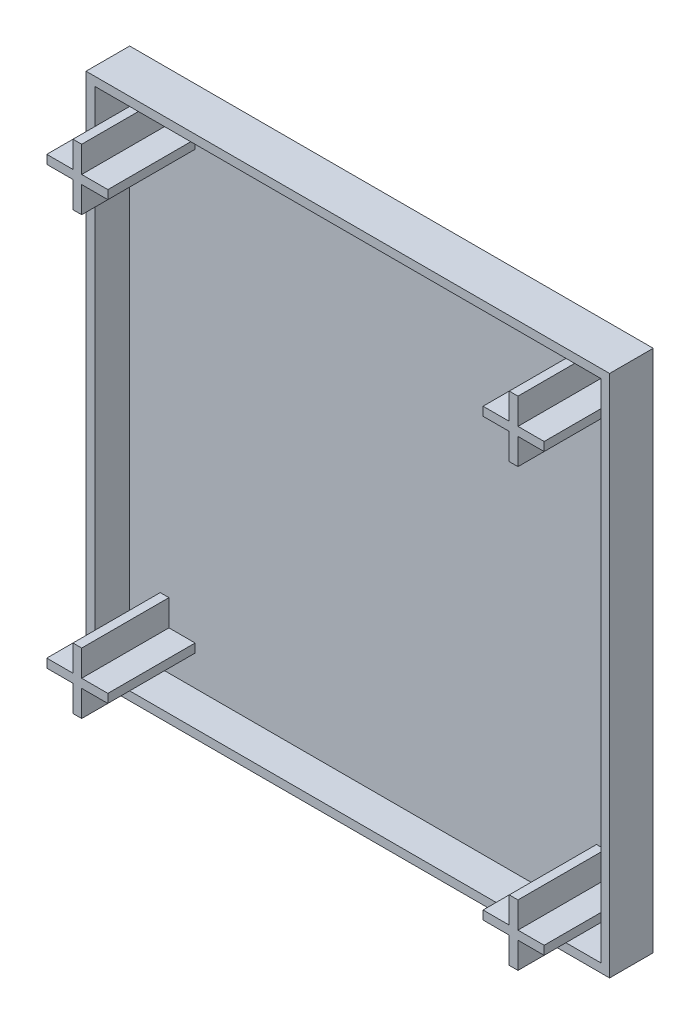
ISO-10303-21;
HEADER;
FILE_DESCRIPTION(('STEP AP214'),'2;1');
FILE_NAME('part.step','',(''),(''),'','','');
FILE_SCHEMA(('AUTOMOTIVE_DESIGN { 1 0 10303 214 1 1 1 1 }'));
ENDSEC;
DATA;
#1=APPLICATION_CONTEXT('core data for automotive mechanical design processes');
#2=APPLICATION_PROTOCOL_DEFINITION('international standard','automotive_design',2000,#1);
#3=PRODUCT_CONTEXT('',#1,'mechanical');
#4=PRODUCT('Part','Part','',(#3));
#5=PRODUCT_RELATED_PRODUCT_CATEGORY('part','',(#4));
#6=PRODUCT_DEFINITION_FORMATION('','',#4);
#7=PRODUCT_DEFINITION_CONTEXT('part definition',#1,'design');
#8=PRODUCT_DEFINITION('design','',#6,#7);
#9=PRODUCT_DEFINITION_SHAPE('','',#8);
#10=(LENGTH_UNIT() NAMED_UNIT(*) SI_UNIT(.MILLI.,.METRE.));
#11=(NAMED_UNIT(*) PLANE_ANGLE_UNIT() SI_UNIT($,.RADIAN.));
#12=(NAMED_UNIT(*) SI_UNIT($,.STERADIAN.) SOLID_ANGLE_UNIT());
#13=UNCERTAINTY_MEASURE_WITH_UNIT(LENGTH_MEASURE(1.E-05),#10,'distance_accuracy_value','');
#14=(GEOMETRIC_REPRESENTATION_CONTEXT(3) GLOBAL_UNCERTAINTY_ASSIGNED_CONTEXT((#13)) GLOBAL_UNIT_ASSIGNED_CONTEXT((#10,
#11,#12)) REPRESENTATION_CONTEXT('',''));
#15=CARTESIAN_POINT('',(0.,0.,0.));
#16=DIRECTION('',(0.,0.,1.));
#17=DIRECTION('',(1.,0.,0.));
#18=AXIS2_PLACEMENT_3D('',#15,#16,#17);
#19=CARTESIAN_POINT('',(0.,0.,-1.5));
#20=DIRECTION('',(0.,0.,1.));
#21=DIRECTION('',(1.,0.,0.));
#22=AXIS2_PLACEMENT_3D('',#19,#20,#21);
#23=PLANE('',#22);
#24=DIRECTION('',(-1.,0.,0.));
#25=VECTOR('',#24,1.);
#26=CARTESIAN_POINT('',(24.5,25.5,-1.5));
#27=LINE('',#26,#25);
#28=CARTESIAN_POINT('',(24.5,25.5,-1.5));
#29=VERTEX_POINT('',#28);
#30=CARTESIAN_POINT('',(21.5,25.5,-1.5));
#31=VERTEX_POINT('',#30);
#32=EDGE_CURVE('E415',#29,#31,#27,.T.);
#33=ORIENTED_EDGE('',*,*,#32,.F.);
#34=DIRECTION('',(0.,-1.,0.));
#35=VECTOR('',#34,1.);
#36=CARTESIAN_POINT('',(24.5,28.5,-1.5));
#37=LINE('',#36,#35);
#38=CARTESIAN_POINT('',(24.5,28.5,-1.5));
#39=VERTEX_POINT('',#38);
#40=EDGE_CURVE('E412',#39,#29,#37,.T.);
#41=ORIENTED_EDGE('',*,*,#40,.F.);
#42=DIRECTION('',(-1.,0.,0.));
#43=VECTOR('',#42,1.);
#44=CARTESIAN_POINT('',(25.5,28.5,-1.5));
#45=LINE('',#44,#43);
#46=CARTESIAN_POINT('',(25.5,28.5,-1.5));
#47=VERTEX_POINT('',#46);
#48=EDGE_CURVE('E425',#47,#39,#45,.T.);
#49=ORIENTED_EDGE('',*,*,#48,.F.);
#50=DIRECTION('',(0.,1.,0.));
#51=VECTOR('',#50,1.);
#52=CARTESIAN_POINT('',(25.5,28.5,-1.5));
#53=LINE('',#52,#51);
#54=CARTESIAN_POINT('',(25.5,25.5,-1.5));
#55=VERTEX_POINT('',#54);
#56=EDGE_CURVE('E465',#55,#47,#53,.T.);
#57=ORIENTED_EDGE('',*,*,#56,.F.);
#58=DIRECTION('',(-1.,0.,0.));
#59=VECTOR('',#58,1.);
#60=CARTESIAN_POINT('',(28.5,25.5,-1.5));
#61=LINE('',#60,#59);
#62=CARTESIAN_POINT('',(28.5,25.5,-1.5));
#63=VERTEX_POINT('',#62);
#64=EDGE_CURVE('E463',#63,#55,#61,.T.);
#65=ORIENTED_EDGE('',*,*,#64,.F.);
#66=DIRECTION('',(0.,1.,0.));
#67=VECTOR('',#66,1.);
#68=CARTESIAN_POINT('',(28.5,25.5,-1.5));
#69=LINE('',#68,#67);
#70=CARTESIAN_POINT('',(28.5,24.5,-1.5));
#71=VERTEX_POINT('',#70);
#72=EDGE_CURVE('E461',#71,#63,#69,.T.);
#73=ORIENTED_EDGE('',*,*,#72,.F.);
#74=DIRECTION('',(1.,0.,0.));
#75=VECTOR('',#74,1.);
#76=CARTESIAN_POINT('',(28.5,24.5,-1.5));
#77=LINE('',#76,#75);
#78=CARTESIAN_POINT('',(25.5,24.5,-1.5));
#79=VERTEX_POINT('',#78);
#80=EDGE_CURVE('E459',#79,#71,#77,.T.);
#81=ORIENTED_EDGE('',*,*,#80,.F.);
#82=DIRECTION('',(0.,1.,0.));
#83=VECTOR('',#82,1.);
#84=CARTESIAN_POINT('',(25.5,24.5,-1.5));
#85=LINE('',#84,#83);
#86=CARTESIAN_POINT('',(25.5,21.5,-1.5));
#87=VERTEX_POINT('',#86);
#88=EDGE_CURVE('E457',#87,#79,#85,.T.);
#89=ORIENTED_EDGE('',*,*,#88,.F.);
#90=DIRECTION('',(1.,0.,0.));
#91=VECTOR('',#90,1.);
#92=CARTESIAN_POINT('',(25.5,21.5,-1.5));
#93=LINE('',#92,#91);
#94=CARTESIAN_POINT('',(24.5,21.5,-1.5));
#95=VERTEX_POINT('',#94);
#96=EDGE_CURVE('E455',#95,#87,#93,.T.);
#97=ORIENTED_EDGE('',*,*,#96,.F.);
#98=DIRECTION('',(0.,-1.,0.));
#99=VECTOR('',#98,1.);
#100=CARTESIAN_POINT('',(24.5,24.5,-1.5));
#101=LINE('',#100,#99);
#102=CARTESIAN_POINT('',(24.5,24.5,-1.5));
#103=VERTEX_POINT('',#102);
#104=EDGE_CURVE('E453',#103,#95,#101,.T.);
#105=ORIENTED_EDGE('',*,*,#104,.F.);
#106=DIRECTION('',(1.,0.,0.));
#107=VECTOR('',#106,1.);
#108=CARTESIAN_POINT('',(24.5,24.5,-1.5));
#109=LINE('',#108,#107);
#110=CARTESIAN_POINT('',(21.5,24.5,-1.5));
#111=VERTEX_POINT('',#110);
#112=EDGE_CURVE('E451',#111,#103,#109,.T.);
#113=ORIENTED_EDGE('',*,*,#112,.F.);
#114=DIRECTION('',(0.,-1.,0.));
#115=VECTOR('',#114,1.);
#116=CARTESIAN_POINT('',(21.5,25.5,-1.5));
#117=LINE('',#116,#115);
#118=EDGE_CURVE('E449',#31,#111,#117,.T.);
#119=ORIENTED_EDGE('',*,*,#118,.F.);
#120=EDGE_LOOP('',(#33,#41,#49,#57,#65,#73,#81,#89,#97,#105,#113,#119));
#121=FACE_BOUND('',#120,.T.);
#122=DIRECTION('',(1.,0.,0.));
#123=VECTOR('',#122,1.);
#124=CARTESIAN_POINT('',(-28.5,24.5,-1.5));
#125=LINE('',#124,#123);
#126=CARTESIAN_POINT('',(-28.5,24.5,-1.5));
#127=VERTEX_POINT('',#126);
#128=CARTESIAN_POINT('',(-25.5,24.5,-1.5));
#129=VERTEX_POINT('',#128);
#130=EDGE_CURVE('E615',#127,#129,#125,.T.);
#131=ORIENTED_EDGE('',*,*,#130,.F.);
#132=DIRECTION('',(0.,-1.,0.));
#133=VECTOR('',#132,1.);
#134=CARTESIAN_POINT('',(-28.5,25.5,-1.5));
#135=LINE('',#134,#133);
#136=CARTESIAN_POINT('',(-28.5,25.5,-1.5));
#137=VERTEX_POINT('',#136);
#138=EDGE_CURVE('E585',#137,#127,#135,.T.);
#139=ORIENTED_EDGE('',*,*,#138,.F.);
#140=DIRECTION('',(-1.,0.,0.));
#141=VECTOR('',#140,1.);
#142=CARTESIAN_POINT('',(-28.5,25.5,-1.5));
#143=LINE('',#142,#141);
#144=CARTESIAN_POINT('',(-25.5,25.5,-1.5));
#145=VERTEX_POINT('',#144);
#146=EDGE_CURVE('E590',#145,#137,#143,.T.);
#147=ORIENTED_EDGE('',*,*,#146,.F.);
#148=DIRECTION('',(0.,-1.,0.));
#149=VECTOR('',#148,1.);
#150=CARTESIAN_POINT('',(-25.5,28.5,-1.5));
#151=LINE('',#150,#149);
#152=CARTESIAN_POINT('',(-25.5,28.5,-1.5));
#153=VERTEX_POINT('',#152);
#154=EDGE_CURVE('E633',#153,#145,#151,.T.);
#155=ORIENTED_EDGE('',*,*,#154,.F.);
#156=DIRECTION('',(-1.,0.,0.));
#157=VECTOR('',#156,1.);
#158=CARTESIAN_POINT('',(-25.5,28.5,-1.5));
#159=LINE('',#158,#157);
#160=CARTESIAN_POINT('',(-24.5,28.5,-1.5));
#161=VERTEX_POINT('',#160);
#162=EDGE_CURVE('E631',#161,#153,#159,.T.);
#163=ORIENTED_EDGE('',*,*,#162,.F.);
#164=DIRECTION('',(0.,1.,0.));
#165=VECTOR('',#164,1.);
#166=CARTESIAN_POINT('',(-24.5,28.5,-1.5));
#167=LINE('',#166,#165);
#168=CARTESIAN_POINT('',(-24.5,25.5,-1.5));
#169=VERTEX_POINT('',#168);
#170=EDGE_CURVE('E629',#169,#161,#167,.T.);
#171=ORIENTED_EDGE('',*,*,#170,.F.);
#172=DIRECTION('',(-1.,0.,0.));
#173=VECTOR('',#172,1.);
#174=CARTESIAN_POINT('',(-24.5,25.5,-1.5));
#175=LINE('',#174,#173);
#176=CARTESIAN_POINT('',(-21.5,25.5,-1.5));
#177=VERTEX_POINT('',#176);
#178=EDGE_CURVE('E627',#177,#169,#175,.T.);
#179=ORIENTED_EDGE('',*,*,#178,.F.);
#180=DIRECTION('',(0.,1.,0.));
#181=VECTOR('',#180,1.);
#182=CARTESIAN_POINT('',(-21.5,25.5,-1.5));
#183=LINE('',#182,#181);
#184=CARTESIAN_POINT('',(-21.5,24.5,-1.5));
#185=VERTEX_POINT('',#184);
#186=EDGE_CURVE('E625',#185,#177,#183,.T.);
#187=ORIENTED_EDGE('',*,*,#186,.F.);
#188=DIRECTION('',(1.,0.,0.));
#189=VECTOR('',#188,1.);
#190=CARTESIAN_POINT('',(-24.5,24.5,-1.5));
#191=LINE('',#190,#189);
#192=CARTESIAN_POINT('',(-24.5,24.5,-1.5));
#193=VERTEX_POINT('',#192);
#194=EDGE_CURVE('E623',#193,#185,#191,.T.);
#195=ORIENTED_EDGE('',*,*,#194,.F.);
#196=DIRECTION('',(0.,1.,0.));
#197=VECTOR('',#196,1.);
#198=CARTESIAN_POINT('',(-24.5,24.5,-1.5));
#199=LINE('',#198,#197);
#200=CARTESIAN_POINT('',(-24.5,21.5,-1.5));
#201=VERTEX_POINT('',#200);
#202=EDGE_CURVE('E621',#201,#193,#199,.T.);
#203=ORIENTED_EDGE('',*,*,#202,.F.);
#204=DIRECTION('',(1.,0.,0.));
#205=VECTOR('',#204,1.);
#206=CARTESIAN_POINT('',(-25.5,21.5,-1.5));
#207=LINE('',#206,#205);
#208=CARTESIAN_POINT('',(-25.5,21.5,-1.5));
#209=VERTEX_POINT('',#208);
#210=EDGE_CURVE('E619',#209,#201,#207,.T.);
#211=ORIENTED_EDGE('',*,*,#210,.F.);
#212=DIRECTION('',(0.,-1.,0.));
#213=VECTOR('',#212,1.);
#214=CARTESIAN_POINT('',(-25.5,24.5,-1.5));
#215=LINE('',#214,#213);
#216=EDGE_CURVE('E617',#129,#209,#215,.T.);
#217=ORIENTED_EDGE('',*,*,#216,.F.);
#218=EDGE_LOOP('',(#131,#139,#147,#155,#163,#171,#179,#187,#195,#203,#211,#217));
#219=FACE_BOUND('',#218,.T.);
#220=DIRECTION('',(0.,-1.,0.));
#221=VECTOR('',#220,1.);
#222=CARTESIAN_POINT('',(-29.,30.,-1.5));
#223=LINE('',#222,#221);
#224=CARTESIAN_POINT('',(-29.,29.,-1.5));
#225=VERTEX_POINT('',#224);
#226=CARTESIAN_POINT('',(-29.,-29.,-1.5));
#227=VERTEX_POINT('',#226);
#228=EDGE_CURVE('E670',#225,#227,#223,.T.);
#229=ORIENTED_EDGE('',*,*,#228,.T.);
#230=DIRECTION('',(1.,0.,0.));
#231=VECTOR('',#230,1.);
#232=CARTESIAN_POINT('',(-30.,-29.,-1.5));
#233=LINE('',#232,#231);
#234=CARTESIAN_POINT('',(29.,-29.,-1.5));
#235=VERTEX_POINT('',#234);
#236=EDGE_CURVE('E673',#227,#235,#233,.T.);
#237=ORIENTED_EDGE('',*,*,#236,.T.);
#238=DIRECTION('',(0.,1.,0.));
#239=VECTOR('',#238,1.);
#240=CARTESIAN_POINT('',(29.,30.,-1.5));
#241=LINE('',#240,#239);
#242=CARTESIAN_POINT('',(29.,29.,-1.5));
#243=VERTEX_POINT('',#242);
#244=EDGE_CURVE('E685',#235,#243,#241,.T.);
#245=ORIENTED_EDGE('',*,*,#244,.T.);
#246=DIRECTION('',(-1.,0.,0.));
#247=VECTOR('',#246,1.);
#248=CARTESIAN_POINT('',(-30.,29.,-1.5));
#249=LINE('',#248,#247);
#250=EDGE_CURVE('E689',#243,#225,#249,.T.);
#251=ORIENTED_EDGE('',*,*,#250,.T.);
#252=EDGE_LOOP('',(#229,#237,#245,#251));
#253=FACE_BOUND('',#252,.T.);
#254=DIRECTION('',(-1.,0.,0.));
#255=VECTOR('',#254,1.);
#256=CARTESIAN_POINT('',(-28.5,-24.5,-1.5));
#257=LINE('',#256,#255);
#258=CARTESIAN_POINT('',(-25.5,-24.5,-1.5));
#259=VERTEX_POINT('',#258);
#260=CARTESIAN_POINT('',(-28.5,-24.5,-1.5));
#261=VERTEX_POINT('',#260);
#262=EDGE_CURVE('E530',#259,#261,#257,.T.);
#263=ORIENTED_EDGE('',*,*,#262,.F.);
#264=DIRECTION('',(0.,-1.,0.));
#265=VECTOR('',#264,1.);
#266=CARTESIAN_POINT('',(-25.5,-24.5,-1.5));
#267=LINE('',#266,#265);
#268=CARTESIAN_POINT('',(-25.5,-21.5,-1.5));
#269=VERTEX_POINT('',#268);
#270=EDGE_CURVE('E500',#269,#259,#267,.T.);
#271=ORIENTED_EDGE('',*,*,#270,.F.);
#272=DIRECTION('',(-1.,0.,0.));
#273=VECTOR('',#272,1.);
#274=CARTESIAN_POINT('',(-25.5,-21.5,-1.5));
#275=LINE('',#274,#273);
#276=CARTESIAN_POINT('',(-24.5,-21.5,-1.5));
#277=VERTEX_POINT('',#276);
#278=EDGE_CURVE('E505',#277,#269,#275,.T.);
#279=ORIENTED_EDGE('',*,*,#278,.F.);
#280=DIRECTION('',(0.,1.,0.));
#281=VECTOR('',#280,1.);
#282=CARTESIAN_POINT('',(-24.5,-24.5,-1.5));
#283=LINE('',#282,#281);
#284=CARTESIAN_POINT('',(-24.5,-24.5,-1.5));
#285=VERTEX_POINT('',#284);
#286=EDGE_CURVE('E548',#285,#277,#283,.T.);
#287=ORIENTED_EDGE('',*,*,#286,.F.);
#288=DIRECTION('',(-1.,0.,0.));
#289=VECTOR('',#288,1.);
#290=CARTESIAN_POINT('',(-24.5,-24.5,-1.5));
#291=LINE('',#290,#289);
#292=CARTESIAN_POINT('',(-21.5,-24.5,-1.5));
#293=VERTEX_POINT('',#292);
#294=EDGE_CURVE('E546',#293,#285,#291,.T.);
#295=ORIENTED_EDGE('',*,*,#294,.F.);
#296=DIRECTION('',(0.,1.,0.));
#297=VECTOR('',#296,1.);
#298=CARTESIAN_POINT('',(-21.5,-25.5,-1.5));
#299=LINE('',#298,#297);
#300=CARTESIAN_POINT('',(-21.5,-25.5,-1.5));
#301=VERTEX_POINT('',#300);
#302=EDGE_CURVE('E544',#301,#293,#299,.T.);
#303=ORIENTED_EDGE('',*,*,#302,.F.);
#304=DIRECTION('',(1.,0.,0.));
#305=VECTOR('',#304,1.);
#306=CARTESIAN_POINT('',(-24.5,-25.5,-1.5));
#307=LINE('',#306,#305);
#308=CARTESIAN_POINT('',(-24.5,-25.5,-1.5));
#309=VERTEX_POINT('',#308);
#310=EDGE_CURVE('E542',#309,#301,#307,.T.);
#311=ORIENTED_EDGE('',*,*,#310,.F.);
#312=DIRECTION('',(0.,1.,0.));
#313=VECTOR('',#312,1.);
#314=CARTESIAN_POINT('',(-24.5,-28.5,-1.5));
#315=LINE('',#314,#313);
#316=CARTESIAN_POINT('',(-24.5,-28.5,-1.5));
#317=VERTEX_POINT('',#316);
#318=EDGE_CURVE('E540',#317,#309,#315,.T.);
#319=ORIENTED_EDGE('',*,*,#318,.F.);
#320=DIRECTION('',(1.,0.,0.));
#321=VECTOR('',#320,1.);
#322=CARTESIAN_POINT('',(-25.5,-28.5,-1.5));
#323=LINE('',#322,#321);
#324=CARTESIAN_POINT('',(-25.5,-28.5,-1.5));
#325=VERTEX_POINT('',#324);
#326=EDGE_CURVE('E538',#325,#317,#323,.T.);
#327=ORIENTED_EDGE('',*,*,#326,.F.);
#328=DIRECTION('',(0.,-1.,0.));
#329=VECTOR('',#328,1.);
#330=CARTESIAN_POINT('',(-25.5,-28.5,-1.5));
#331=LINE('',#330,#329);
#332=CARTESIAN_POINT('',(-25.5,-25.5,-1.5));
#333=VERTEX_POINT('',#332);
#334=EDGE_CURVE('E536',#333,#325,#331,.T.);
#335=ORIENTED_EDGE('',*,*,#334,.F.);
#336=DIRECTION('',(1.,0.,0.));
#337=VECTOR('',#336,1.);
#338=CARTESIAN_POINT('',(-28.5,-25.5,-1.5));
#339=LINE('',#338,#337);
#340=CARTESIAN_POINT('',(-28.5,-25.5,-1.5));
#341=VERTEX_POINT('',#340);
#342=EDGE_CURVE('E534',#341,#333,#339,.T.);
#343=ORIENTED_EDGE('',*,*,#342,.F.);
#344=DIRECTION('',(0.,-1.,0.));
#345=VECTOR('',#344,1.);
#346=CARTESIAN_POINT('',(-28.5,-25.5,-1.5));
#347=LINE('',#346,#345);
#348=EDGE_CURVE('E532',#261,#341,#347,.T.);
#349=ORIENTED_EDGE('',*,*,#348,.F.);
#350=EDGE_LOOP('',(#263,#271,#279,#287,#295,#303,#311,#319,#327,#335,#343,#349));
#351=FACE_BOUND('',#350,.T.);
#352=DIRECTION('',(-1.,0.,0.));
#353=VECTOR('',#352,1.);
#354=CARTESIAN_POINT('',(28.5,-24.5,-1.5));
#355=LINE('',#354,#353);
#356=CARTESIAN_POINT('',(28.5,-24.5,-1.5));
#357=VERTEX_POINT('',#356);
#358=CARTESIAN_POINT('',(25.5,-24.5,-1.5));
#359=VERTEX_POINT('',#358);
#360=EDGE_CURVE('E1363',#357,#359,#355,.T.);
#361=ORIENTED_EDGE('',*,*,#360,.F.);
#362=DIRECTION('',(0.,1.,0.));
#363=VECTOR('',#362,1.);
#364=CARTESIAN_POINT('',(28.5,-25.5,-1.5));
#365=LINE('',#364,#363);
#366=CARTESIAN_POINT('',(28.5,-25.5,-1.5));
#367=VERTEX_POINT('',#366);
#368=EDGE_CURVE('E410',#367,#357,#365,.T.);
#369=ORIENTED_EDGE('',*,*,#368,.F.);
#370=DIRECTION('',(1.,0.,0.));
#371=VECTOR('',#370,1.);
#372=CARTESIAN_POINT('',(28.5,-25.5,-1.5));
#373=LINE('',#372,#371);
#374=CARTESIAN_POINT('',(25.5,-25.5,-1.5));
#375=VERTEX_POINT('',#374);
#376=EDGE_CURVE('E406',#375,#367,#373,.T.);
#377=ORIENTED_EDGE('',*,*,#376,.F.);
#378=DIRECTION('',(0.,1.,0.));
#379=VECTOR('',#378,1.);
#380=CARTESIAN_POINT('',(25.5,-28.5,-1.5));
#381=LINE('',#380,#379);
#382=CARTESIAN_POINT('',(25.5,-28.5,-1.5));
#383=VERTEX_POINT('',#382);
#384=EDGE_CURVE('E1359',#383,#375,#381,.T.);
#385=ORIENTED_EDGE('',*,*,#384,.F.);
#386=DIRECTION('',(1.,0.,0.));
#387=VECTOR('',#386,1.);
#388=CARTESIAN_POINT('',(25.5,-28.5,-1.5));
#389=LINE('',#388,#387);
#390=CARTESIAN_POINT('',(24.5,-28.5,-1.5));
#391=VERTEX_POINT('',#390);
#392=EDGE_CURVE('E1383',#391,#383,#389,.T.);
#393=ORIENTED_EDGE('',*,*,#392,.F.);
#394=DIRECTION('',(0.,-1.,0.));
#395=VECTOR('',#394,1.);
#396=CARTESIAN_POINT('',(24.5,-28.5,-1.5));
#397=LINE('',#396,#395);
#398=CARTESIAN_POINT('',(24.5,-25.5,-1.5));
#399=VERTEX_POINT('',#398);
#400=EDGE_CURVE('E1381',#399,#391,#397,.T.);
#401=ORIENTED_EDGE('',*,*,#400,.F.);
#402=DIRECTION('',(1.,0.,0.));
#403=VECTOR('',#402,1.);
#404=CARTESIAN_POINT('',(24.5,-25.5,-1.5));
#405=LINE('',#404,#403);
#406=CARTESIAN_POINT('',(21.5,-25.5,-1.5));
#407=VERTEX_POINT('',#406);
#408=EDGE_CURVE('E1379',#407,#399,#405,.T.);
#409=ORIENTED_EDGE('',*,*,#408,.F.);
#410=DIRECTION('',(0.,-1.,0.));
#411=VECTOR('',#410,1.);
#412=CARTESIAN_POINT('',(21.5,-25.5,-1.5));
#413=LINE('',#412,#411);
#414=CARTESIAN_POINT('',(21.5,-24.5,-1.5));
#415=VERTEX_POINT('',#414);
#416=EDGE_CURVE('E1377',#415,#407,#413,.T.);
#417=ORIENTED_EDGE('',*,*,#416,.F.);
#418=DIRECTION('',(-1.,0.,0.));
#419=VECTOR('',#418,1.);
#420=CARTESIAN_POINT('',(24.5,-24.5,-1.5));
#421=LINE('',#420,#419);
#422=CARTESIAN_POINT('',(24.5,-24.5,-1.5));
#423=VERTEX_POINT('',#422);
#424=EDGE_CURVE('E1375',#423,#415,#421,.T.);
#425=ORIENTED_EDGE('',*,*,#424,.F.);
#426=DIRECTION('',(0.,-1.,0.));
#427=VECTOR('',#426,1.);
#428=CARTESIAN_POINT('',(24.5,-24.5,-1.5));
#429=LINE('',#428,#427);
#430=CARTESIAN_POINT('',(24.5,-21.5,-1.5));
#431=VERTEX_POINT('',#430);
#432=EDGE_CURVE('E1373',#431,#423,#429,.T.);
#433=ORIENTED_EDGE('',*,*,#432,.F.);
#434=DIRECTION('',(-1.,0.,0.));
#435=VECTOR('',#434,1.);
#436=CARTESIAN_POINT('',(25.5,-21.5,-1.5));
#437=LINE('',#436,#435);
#438=CARTESIAN_POINT('',(25.5,-21.5,-1.5));
#439=VERTEX_POINT('',#438);
#440=EDGE_CURVE('E1371',#439,#431,#437,.T.);
#441=ORIENTED_EDGE('',*,*,#440,.F.);
#442=DIRECTION('',(0.,1.,0.));
#443=VECTOR('',#442,1.);
#444=CARTESIAN_POINT('',(25.5,-24.5,-1.5));
#445=LINE('',#444,#443);
#446=EDGE_CURVE('E1365',#359,#439,#445,.T.);
#447=ORIENTED_EDGE('',*,*,#446,.F.);
#448=EDGE_LOOP('',(#361,#369,#377,#385,#393,#401,#409,#417,#425,#433,#441,#447));
#449=FACE_BOUND('',#448,.T.);
#450=ADVANCED_FACE('F33',(#121,#219,#253,#351,#449),#23,.T.);
#451=CARTESIAN_POINT('',(-30.,30.,2.5));
#452=DIRECTION('',(1.,0.,0.));
#453=DIRECTION('',(0.,1.,0.));
#454=AXIS2_PLACEMENT_3D('',#451,#452,#453);
#455=PLANE('',#454);
#456=DIRECTION('',(0.,-1.,0.));
#457=VECTOR('',#456,1.);
#458=CARTESIAN_POINT('',(-30.,30.,-2.5));
#459=LINE('',#458,#457);
#460=CARTESIAN_POINT('',(-30.,30.,-2.5));
#461=VERTEX_POINT('',#460);
#462=CARTESIAN_POINT('',(-30.,-30.,-2.5));
#463=VERTEX_POINT('',#462);
#464=EDGE_CURVE('E677',#461,#463,#459,.T.);
#465=ORIENTED_EDGE('',*,*,#464,.T.);
#466=DIRECTION('',(0.,0.,-1.));
#467=VECTOR('',#466,1.);
#468=CARTESIAN_POINT('',(-30.,-30.,2.5));
#469=LINE('',#468,#467);
#470=CARTESIAN_POINT('',(-30.,-30.,2.5));
#471=VERTEX_POINT('',#470);
#472=EDGE_CURVE('E11',#471,#463,#469,.T.);
#473=ORIENTED_EDGE('',*,*,#472,.F.);
#474=DIRECTION('',(0.,-1.,0.));
#475=VECTOR('',#474,1.);
#476=CARTESIAN_POINT('',(-30.,30.,2.5));
#477=LINE('',#476,#475);
#478=CARTESIAN_POINT('',(-30.,30.,2.5));
#479=VERTEX_POINT('',#478);
#480=EDGE_CURVE('E701',#479,#471,#477,.T.);
#481=ORIENTED_EDGE('',*,*,#480,.F.);
#482=DIRECTION('',(0.,0.,-1.));
#483=VECTOR('',#482,1.);
#484=CARTESIAN_POINT('',(-30.,30.,2.5));
#485=LINE('',#484,#483);
#486=EDGE_CURVE('E711',#479,#461,#485,.T.);
#487=ORIENTED_EDGE('',*,*,#486,.T.);
#488=EDGE_LOOP('',(#465,#473,#481,#487));
#489=FACE_BOUND('',#488,.T.);
#490=ADVANCED_FACE('F35',(#489),#455,.F.);
#491=CARTESIAN_POINT('',(-30.,-30.,2.5));
#492=DIRECTION('',(0.,1.,0.));
#493=DIRECTION('',(-1.,0.,0.));
#494=AXIS2_PLACEMENT_3D('',#491,#492,#493);
#495=PLANE('',#494);
#496=DIRECTION('',(1.,0.,0.));
#497=VECTOR('',#496,1.);
#498=CARTESIAN_POINT('',(-30.,-30.,-2.5));
#499=LINE('',#498,#497);
#500=CARTESIAN_POINT('',(30.,-30.,-2.5));
#501=VERTEX_POINT('',#500);
#502=EDGE_CURVE('E714',#463,#501,#499,.T.);
#503=ORIENTED_EDGE('',*,*,#502,.T.);
#504=DIRECTION('',(0.,0.,-1.));
#505=VECTOR('',#504,1.);
#506=CARTESIAN_POINT('',(30.,-30.,2.5));
#507=LINE('',#506,#505);
#508=CARTESIAN_POINT('',(30.,-30.,2.5));
#509=VERTEX_POINT('',#508);
#510=EDGE_CURVE('E41',#509,#501,#507,.T.);
#511=ORIENTED_EDGE('',*,*,#510,.F.);
#512=DIRECTION('',(1.,0.,0.));
#513=VECTOR('',#512,1.);
#514=CARTESIAN_POINT('',(-30.,-30.,2.5));
#515=LINE('',#514,#513);
#516=EDGE_CURVE('E704',#471,#509,#515,.T.);
#517=ORIENTED_EDGE('',*,*,#516,.F.);
#518=ORIENTED_EDGE('',*,*,#472,.T.);
#519=EDGE_LOOP('',(#503,#511,#517,#518));
#520=FACE_BOUND('',#519,.T.);
#521=ADVANCED_FACE('F744',(#520),#495,.F.);
#522=CARTESIAN_POINT('',(30.,30.,2.5));
#523=DIRECTION('',(-1.,0.,0.));
#524=DIRECTION('',(0.,0.,1.));
#525=AXIS2_PLACEMENT_3D('',#522,#523,#524);
#526=PLANE('',#525);
#527=DIRECTION('',(0.,1.,0.));
#528=VECTOR('',#527,1.);
#529=CARTESIAN_POINT('',(30.,30.,-2.5));
#530=LINE('',#529,#528);
#531=CARTESIAN_POINT('',(30.,30.,-2.5));
#532=VERTEX_POINT('',#531);
#533=EDGE_CURVE('E716',#501,#532,#530,.T.);
#534=ORIENTED_EDGE('',*,*,#533,.T.);
#535=DIRECTION('',(0.,0.,-1.));
#536=VECTOR('',#535,1.);
#537=CARTESIAN_POINT('',(30.,30.,2.5));
#538=LINE('',#537,#536);
#539=CARTESIAN_POINT('',(30.,30.,2.5));
#540=VERTEX_POINT('',#539);
#541=EDGE_CURVE('E721',#540,#532,#538,.T.);
#542=ORIENTED_EDGE('',*,*,#541,.F.);
#543=DIRECTION('',(0.,1.,0.));
#544=VECTOR('',#543,1.);
#545=CARTESIAN_POINT('',(30.,30.,2.5));
#546=LINE('',#545,#544);
#547=EDGE_CURVE('E707',#509,#540,#546,.T.);
#548=ORIENTED_EDGE('',*,*,#547,.F.);
#549=ORIENTED_EDGE('',*,*,#510,.T.);
#550=EDGE_LOOP('',(#534,#542,#548,#549));
#551=FACE_BOUND('',#550,.T.);
#552=ADVANCED_FACE('F728',(#551),#526,.F.);
#553=CARTESIAN_POINT('',(-30.,30.,2.5));
#554=DIRECTION('',(0.,-1.,0.));
#555=DIRECTION('',(1.,0.,0.));
#556=AXIS2_PLACEMENT_3D('',#553,#554,#555);
#557=PLANE('',#556);
#558=DIRECTION('',(-1.,0.,0.));
#559=VECTOR('',#558,1.);
#560=CARTESIAN_POINT('',(-30.,30.,-2.5));
#561=LINE('',#560,#559);
#562=EDGE_CURVE('E705',#532,#461,#561,.T.);
#563=ORIENTED_EDGE('',*,*,#562,.T.);
#564=ORIENTED_EDGE('',*,*,#486,.F.);
#565=DIRECTION('',(-1.,0.,0.));
#566=VECTOR('',#565,1.);
#567=CARTESIAN_POINT('',(-30.,30.,2.5));
#568=LINE('',#567,#566);
#569=EDGE_CURVE('E709',#540,#479,#568,.T.);
#570=ORIENTED_EDGE('',*,*,#569,.F.);
#571=ORIENTED_EDGE('',*,*,#541,.T.);
#572=EDGE_LOOP('',(#563,#564,#570,#571));
#573=FACE_BOUND('',#572,.T.);
#574=ADVANCED_FACE('F737',(#573),#557,.F.);
#575=CARTESIAN_POINT('',(0.,0.,2.5));
#576=DIRECTION('',(0.,0.,1.));
#577=DIRECTION('',(1.,0.,0.));
#578=AXIS2_PLACEMENT_3D('',#575,#576,#577);
#579=PLANE('',#578);
#580=DIRECTION('',(0.,-1.,0.));
#581=VECTOR('',#580,1.);
#582=CARTESIAN_POINT('',(-29.,30.,2.5));
#583=LINE('',#582,#581);
#584=CARTESIAN_POINT('',(-29.,29.,2.5));
#585=VERTEX_POINT('',#584);
#586=CARTESIAN_POINT('',(-29.,-29.,2.5));
#587=VERTEX_POINT('',#586);
#588=EDGE_CURVE('E693',#585,#587,#583,.T.);
#589=ORIENTED_EDGE('',*,*,#588,.F.);
#590=DIRECTION('',(-1.,0.,0.));
#591=VECTOR('',#590,1.);
#592=CARTESIAN_POINT('',(-30.,29.,2.5));
#593=LINE('',#592,#591);
#594=CARTESIAN_POINT('',(29.,29.,2.5));
#595=VERTEX_POINT('',#594);
#596=EDGE_CURVE('E683',#595,#585,#593,.T.);
#597=ORIENTED_EDGE('',*,*,#596,.F.);
#598=DIRECTION('',(0.,1.,0.));
#599=VECTOR('',#598,1.);
#600=CARTESIAN_POINT('',(29.,30.,2.5));
#601=LINE('',#600,#599);
#602=CARTESIAN_POINT('',(29.,-29.,2.5));
#603=VERTEX_POINT('',#602);
#604=EDGE_CURVE('E697',#603,#595,#601,.T.);
#605=ORIENTED_EDGE('',*,*,#604,.F.);
#606=DIRECTION('',(1.,0.,0.));
#607=VECTOR('',#606,1.);
#608=CARTESIAN_POINT('',(-30.,-29.,2.5));
#609=LINE('',#608,#607);
#610=EDGE_CURVE('E695',#587,#603,#609,.T.);
#611=ORIENTED_EDGE('',*,*,#610,.F.);
#612=EDGE_LOOP('',(#589,#597,#605,#611));
#613=FACE_BOUND('',#612,.T.);
#614=ORIENTED_EDGE('',*,*,#480,.T.);
#615=ORIENTED_EDGE('',*,*,#516,.T.);
#616=ORIENTED_EDGE('',*,*,#547,.T.);
#617=ORIENTED_EDGE('',*,*,#569,.T.);
#618=EDGE_LOOP('',(#614,#615,#616,#617));
#619=FACE_BOUND('',#618,.T.);
#620=ADVANCED_FACE('F743',(#613,#619),#579,.T.);
#621=CARTESIAN_POINT('',(0.,0.,-2.5));
#622=DIRECTION('',(0.,0.,1.));
#623=DIRECTION('',(1.,0.,0.));
#624=AXIS2_PLACEMENT_3D('',#621,#622,#623);
#625=PLANE('',#624);
#626=ORIENTED_EDGE('',*,*,#464,.F.);
#627=ORIENTED_EDGE('',*,*,#562,.F.);
#628=ORIENTED_EDGE('',*,*,#533,.F.);
#629=ORIENTED_EDGE('',*,*,#502,.F.);
#630=EDGE_LOOP('',(#626,#627,#628,#629));
#631=FACE_BOUND('',#630,.T.);
#632=ADVANCED_FACE('F734',(#631),#625,.F.);
#633=CARTESIAN_POINT('',(-29.,30.,2.5));
#634=DIRECTION('',(1.,0.,0.));
#635=DIRECTION('',(0.,1.,0.));
#636=AXIS2_PLACEMENT_3D('',#633,#634,#635);
#637=PLANE('',#636);
#638=ORIENTED_EDGE('',*,*,#228,.F.);
#639=DIRECTION('',(0.,0.,-1.));
#640=VECTOR('',#639,1.);
#641=CARTESIAN_POINT('',(-29.,29.,2.5));
#642=LINE('',#641,#640);
#643=EDGE_CURVE('E679',#585,#225,#642,.T.);
#644=ORIENTED_EDGE('',*,*,#643,.F.);
#645=ORIENTED_EDGE('',*,*,#588,.T.);
#646=DIRECTION('',(0.,0.,-1.));
#647=VECTOR('',#646,1.);
#648=CARTESIAN_POINT('',(-29.,-29.,2.5));
#649=LINE('',#648,#647);
#650=EDGE_CURVE('E674',#587,#227,#649,.T.);
#651=ORIENTED_EDGE('',*,*,#650,.T.);
#652=EDGE_LOOP('',(#638,#644,#645,#651));
#653=FACE_BOUND('',#652,.T.);
#654=ADVANCED_FACE('F767',(#653),#637,.T.);
#655=CARTESIAN_POINT('',(-30.,-29.,2.5));
#656=DIRECTION('',(0.,1.,0.));
#657=DIRECTION('',(-1.,0.,0.));
#658=AXIS2_PLACEMENT_3D('',#655,#656,#657);
#659=PLANE('',#658);
#660=ORIENTED_EDGE('',*,*,#236,.F.);
#661=ORIENTED_EDGE('',*,*,#650,.F.);
#662=ORIENTED_EDGE('',*,*,#610,.T.);
#663=DIRECTION('',(0.,0.,-1.));
#664=VECTOR('',#663,1.);
#665=CARTESIAN_POINT('',(29.,-29.,2.5));
#666=LINE('',#665,#664);
#667=EDGE_CURVE('E678',#603,#235,#666,.T.);
#668=ORIENTED_EDGE('',*,*,#667,.T.);
#669=EDGE_LOOP('',(#660,#661,#662,#668));
#670=FACE_BOUND('',#669,.T.);
#671=ADVANCED_FACE('F787',(#670),#659,.T.);
#672=CARTESIAN_POINT('',(29.,30.,2.5));
#673=DIRECTION('',(-1.,0.,0.));
#674=DIRECTION('',(0.,0.,1.));
#675=AXIS2_PLACEMENT_3D('',#672,#673,#674);
#676=PLANE('',#675);
#677=ORIENTED_EDGE('',*,*,#244,.F.);
#678=ORIENTED_EDGE('',*,*,#667,.F.);
#679=ORIENTED_EDGE('',*,*,#604,.T.);
#680=DIRECTION('',(0.,0.,-1.));
#681=VECTOR('',#680,1.);
#682=CARTESIAN_POINT('',(29.,29.,2.5));
#683=LINE('',#682,#681);
#684=EDGE_CURVE('E682',#595,#243,#683,.T.);
#685=ORIENTED_EDGE('',*,*,#684,.T.);
#686=EDGE_LOOP('',(#677,#678,#679,#685));
#687=FACE_BOUND('',#686,.T.);
#688=ADVANCED_FACE('F795',(#687),#676,.T.);
#689=CARTESIAN_POINT('',(-30.,29.,2.5));
#690=DIRECTION('',(0.,-1.,0.));
#691=DIRECTION('',(1.,0.,0.));
#692=AXIS2_PLACEMENT_3D('',#689,#690,#691);
#693=PLANE('',#692);
#694=ORIENTED_EDGE('',*,*,#250,.F.);
#695=ORIENTED_EDGE('',*,*,#684,.F.);
#696=ORIENTED_EDGE('',*,*,#596,.T.);
#697=ORIENTED_EDGE('',*,*,#643,.T.);
#698=EDGE_LOOP('',(#694,#695,#696,#697));
#699=FACE_BOUND('',#698,.T.);
#700=ADVANCED_FACE('F760',(#699),#693,.T.);
#701=CARTESIAN_POINT('',(-28.5,25.5,8.5));
#702=DIRECTION('',(1.,0.,0.));
#703=DIRECTION('',(0.,0.,-1.));
#704=AXIS2_PLACEMENT_3D('',#701,#702,#703);
#705=PLANE('',#704);
#706=ORIENTED_EDGE('',*,*,#138,.T.);
#707=DIRECTION('',(0.,0.,-1.));
#708=VECTOR('',#707,1.);
#709=CARTESIAN_POINT('',(-28.5,24.5,8.5));
#710=LINE('',#709,#708);
#711=CARTESIAN_POINT('',(-28.5,24.5,8.5));
#712=VERTEX_POINT('',#711);
#713=EDGE_CURVE('E668',#712,#127,#710,.T.);
#714=ORIENTED_EDGE('',*,*,#713,.F.);
#715=DIRECTION('',(0.,-1.,0.));
#716=VECTOR('',#715,1.);
#717=CARTESIAN_POINT('',(-28.5,25.5,8.5));
#718=LINE('',#717,#716);
#719=CARTESIAN_POINT('',(-28.5,25.5,8.5));
#720=VERTEX_POINT('',#719);
#721=EDGE_CURVE('E586',#720,#712,#718,.T.);
#722=ORIENTED_EDGE('',*,*,#721,.F.);
#723=DIRECTION('',(0.,0.,-1.));
#724=VECTOR('',#723,1.);
#725=CARTESIAN_POINT('',(-28.5,25.5,8.5));
#726=LINE('',#725,#724);
#727=EDGE_CURVE('E612',#720,#137,#726,.T.);
#728=ORIENTED_EDGE('',*,*,#727,.T.);
#729=EDGE_LOOP('',(#706,#714,#722,#728));
#730=FACE_BOUND('',#729,.T.);
#731=ADVANCED_FACE('F809',(#730),#705,.F.);
#732=CARTESIAN_POINT('',(-28.5,24.5,8.5));
#733=DIRECTION('',(0.,1.,0.));
#734=DIRECTION('',(0.,0.,1.));
#735=AXIS2_PLACEMENT_3D('',#732,#733,#734);
#736=PLANE('',#735);
#737=ORIENTED_EDGE('',*,*,#130,.T.);
#738=DIRECTION('',(0.,0.,-1.));
#739=VECTOR('',#738,1.);
#740=CARTESIAN_POINT('',(-25.5,24.5,8.5));
#741=LINE('',#740,#739);
#742=CARTESIAN_POINT('',(-25.5,24.5,8.5));
#743=VERTEX_POINT('',#742);
#744=EDGE_CURVE('E665',#743,#129,#741,.T.);
#745=ORIENTED_EDGE('',*,*,#744,.F.);
#746=DIRECTION('',(1.,0.,0.));
#747=VECTOR('',#746,1.);
#748=CARTESIAN_POINT('',(-28.5,24.5,8.5));
#749=LINE('',#748,#747);
#750=EDGE_CURVE('E589',#712,#743,#749,.T.);
#751=ORIENTED_EDGE('',*,*,#750,.F.);
#752=ORIENTED_EDGE('',*,*,#713,.T.);
#753=EDGE_LOOP('',(#737,#745,#751,#752));
#754=FACE_BOUND('',#753,.T.);
#755=ADVANCED_FACE('F816',(#754),#736,.F.);
#756=CARTESIAN_POINT('',(-25.5,24.5,8.5));
#757=DIRECTION('',(1.,0.,0.));
#758=DIRECTION('',(0.,0.,-1.));
#759=AXIS2_PLACEMENT_3D('',#756,#757,#758);
#760=PLANE('',#759);
#761=ORIENTED_EDGE('',*,*,#216,.T.);
#762=DIRECTION('',(0.,0.,-1.));
#763=VECTOR('',#762,1.);
#764=CARTESIAN_POINT('',(-25.5,21.5,8.5));
#765=LINE('',#764,#763);
#766=CARTESIAN_POINT('',(-25.5,21.5,8.5));
#767=VERTEX_POINT('',#766);
#768=EDGE_CURVE('E662',#767,#209,#765,.T.);
#769=ORIENTED_EDGE('',*,*,#768,.F.);
#770=DIRECTION('',(0.,-1.,0.));
#771=VECTOR('',#770,1.);
#772=CARTESIAN_POINT('',(-25.5,24.5,8.5));
#773=LINE('',#772,#771);
#774=EDGE_CURVE('E592',#743,#767,#773,.T.);
#775=ORIENTED_EDGE('',*,*,#774,.F.);
#776=ORIENTED_EDGE('',*,*,#744,.T.);
#777=EDGE_LOOP('',(#761,#769,#775,#776));
#778=FACE_BOUND('',#777,.T.);
#779=ADVANCED_FACE('F824',(#778),#760,.F.);
#780=CARTESIAN_POINT('',(-25.5,21.5,8.5));
#781=DIRECTION('',(0.,1.,0.));
#782=DIRECTION('',(-1.,0.,0.));
#783=AXIS2_PLACEMENT_3D('',#780,#781,#782);
#784=PLANE('',#783);
#785=ORIENTED_EDGE('',*,*,#210,.T.);
#786=DIRECTION('',(0.,0.,-1.));
#787=VECTOR('',#786,1.);
#788=CARTESIAN_POINT('',(-24.5,21.5,8.5));
#789=LINE('',#788,#787);
#790=CARTESIAN_POINT('',(-24.5,21.5,8.5));
#791=VERTEX_POINT('',#790);
#792=EDGE_CURVE('E659',#791,#201,#789,.T.);
#793=ORIENTED_EDGE('',*,*,#792,.F.);
#794=DIRECTION('',(1.,0.,0.));
#795=VECTOR('',#794,1.);
#796=CARTESIAN_POINT('',(-25.5,21.5,8.5));
#797=LINE('',#796,#795);
#798=EDGE_CURVE('E594',#767,#791,#797,.T.);
#799=ORIENTED_EDGE('',*,*,#798,.F.);
#800=ORIENTED_EDGE('',*,*,#768,.T.);
#801=EDGE_LOOP('',(#785,#793,#799,#800));
#802=FACE_BOUND('',#801,.T.);
#803=ADVANCED_FACE('F832',(#802),#784,.F.);
#804=CARTESIAN_POINT('',(-24.5,24.5,8.5));
#805=DIRECTION('',(-1.,0.,0.));
#806=DIRECTION('',(0.,0.,1.));
#807=AXIS2_PLACEMENT_3D('',#804,#805,#806);
#808=PLANE('',#807);
#809=ORIENTED_EDGE('',*,*,#202,.T.);
#810=DIRECTION('',(0.,0.,-1.));
#811=VECTOR('',#810,1.);
#812=CARTESIAN_POINT('',(-24.5,24.5,8.5));
#813=LINE('',#812,#811);
#814=CARTESIAN_POINT('',(-24.5,24.5,8.5));
#815=VERTEX_POINT('',#814);
#816=EDGE_CURVE('E656',#815,#193,#813,.T.);
#817=ORIENTED_EDGE('',*,*,#816,.F.);
#818=DIRECTION('',(0.,1.,0.));
#819=VECTOR('',#818,1.);
#820=CARTESIAN_POINT('',(-24.5,24.5,8.5));
#821=LINE('',#820,#819);
#822=EDGE_CURVE('E596',#791,#815,#821,.T.);
#823=ORIENTED_EDGE('',*,*,#822,.F.);
#824=ORIENTED_EDGE('',*,*,#792,.T.);
#825=EDGE_LOOP('',(#809,#817,#823,#824));
#826=FACE_BOUND('',#825,.T.);
#827=ADVANCED_FACE('F840',(#826),#808,.F.);
#828=CARTESIAN_POINT('',(-24.5,24.5,8.5));
#829=DIRECTION('',(0.,1.,0.));
#830=DIRECTION('',(0.,0.,1.));
#831=AXIS2_PLACEMENT_3D('',#828,#829,#830);
#832=PLANE('',#831);
#833=ORIENTED_EDGE('',*,*,#194,.T.);
#834=DIRECTION('',(0.,0.,-1.));
#835=VECTOR('',#834,1.);
#836=CARTESIAN_POINT('',(-21.5,24.5,8.5));
#837=LINE('',#836,#835);
#838=CARTESIAN_POINT('',(-21.5,24.5,8.5));
#839=VERTEX_POINT('',#838);
#840=EDGE_CURVE('E653',#839,#185,#837,.T.);
#841=ORIENTED_EDGE('',*,*,#840,.F.);
#842=DIRECTION('',(1.,0.,0.));
#843=VECTOR('',#842,1.);
#844=CARTESIAN_POINT('',(-24.5,24.5,8.5));
#845=LINE('',#844,#843);
#846=EDGE_CURVE('E598',#815,#839,#845,.T.);
#847=ORIENTED_EDGE('',*,*,#846,.F.);
#848=ORIENTED_EDGE('',*,*,#816,.T.);
#849=EDGE_LOOP('',(#833,#841,#847,#848));
#850=FACE_BOUND('',#849,.T.);
#851=ADVANCED_FACE('F848',(#850),#832,.F.);
#852=CARTESIAN_POINT('',(-21.5,25.5,8.5));
#853=DIRECTION('',(-1.,0.,0.));
#854=DIRECTION('',(0.,0.,1.));
#855=AXIS2_PLACEMENT_3D('',#852,#853,#854);
#856=PLANE('',#855);
#857=ORIENTED_EDGE('',*,*,#186,.T.);
#858=DIRECTION('',(0.,0.,-1.));
#859=VECTOR('',#858,1.);
#860=CARTESIAN_POINT('',(-21.5,25.5,8.5));
#861=LINE('',#860,#859);
#862=CARTESIAN_POINT('',(-21.5,25.5,8.5));
#863=VERTEX_POINT('',#862);
#864=EDGE_CURVE('E650',#863,#177,#861,.T.);
#865=ORIENTED_EDGE('',*,*,#864,.F.);
#866=DIRECTION('',(0.,1.,0.));
#867=VECTOR('',#866,1.);
#868=CARTESIAN_POINT('',(-21.5,25.5,8.5));
#869=LINE('',#868,#867);
#870=EDGE_CURVE('E600',#839,#863,#869,.T.);
#871=ORIENTED_EDGE('',*,*,#870,.F.);
#872=ORIENTED_EDGE('',*,*,#840,.T.);
#873=EDGE_LOOP('',(#857,#865,#871,#872));
#874=FACE_BOUND('',#873,.T.);
#875=ADVANCED_FACE('F856',(#874),#856,.F.);
#876=CARTESIAN_POINT('',(-24.5,25.5,8.5));
#877=DIRECTION('',(0.,-1.,0.));
#878=DIRECTION('',(0.,0.,-1.));
#879=AXIS2_PLACEMENT_3D('',#876,#877,#878);
#880=PLANE('',#879);
#881=ORIENTED_EDGE('',*,*,#178,.T.);
#882=DIRECTION('',(0.,0.,-1.));
#883=VECTOR('',#882,1.);
#884=CARTESIAN_POINT('',(-24.5,25.5,8.5));
#885=LINE('',#884,#883);
#886=CARTESIAN_POINT('',(-24.5,25.5,8.5));
#887=VERTEX_POINT('',#886);
#888=EDGE_CURVE('E647',#887,#169,#885,.T.);
#889=ORIENTED_EDGE('',*,*,#888,.F.);
#890=DIRECTION('',(-1.,0.,0.));
#891=VECTOR('',#890,1.);
#892=CARTESIAN_POINT('',(-24.5,25.5,8.5));
#893=LINE('',#892,#891);
#894=EDGE_CURVE('E602',#863,#887,#893,.T.);
#895=ORIENTED_EDGE('',*,*,#894,.F.);
#896=ORIENTED_EDGE('',*,*,#864,.T.);
#897=EDGE_LOOP('',(#881,#889,#895,#896));
#898=FACE_BOUND('',#897,.T.);
#899=ADVANCED_FACE('F864',(#898),#880,.F.);
#900=CARTESIAN_POINT('',(-24.5,28.5,8.5));
#901=DIRECTION('',(-1.,0.,0.));
#902=DIRECTION('',(0.,0.,1.));
#903=AXIS2_PLACEMENT_3D('',#900,#901,#902);
#904=PLANE('',#903);
#905=ORIENTED_EDGE('',*,*,#170,.T.);
#906=DIRECTION('',(0.,0.,-1.));
#907=VECTOR('',#906,1.);
#908=CARTESIAN_POINT('',(-24.5,28.5,8.5));
#909=LINE('',#908,#907);
#910=CARTESIAN_POINT('',(-24.5,28.5,8.5));
#911=VERTEX_POINT('',#910);
#912=EDGE_CURVE('E644',#911,#161,#909,.T.);
#913=ORIENTED_EDGE('',*,*,#912,.F.);
#914=DIRECTION('',(0.,1.,0.));
#915=VECTOR('',#914,1.);
#916=CARTESIAN_POINT('',(-24.5,28.5,8.5));
#917=LINE('',#916,#915);
#918=EDGE_CURVE('E604',#887,#911,#917,.T.);
#919=ORIENTED_EDGE('',*,*,#918,.F.);
#920=ORIENTED_EDGE('',*,*,#888,.T.);
#921=EDGE_LOOP('',(#905,#913,#919,#920));
#922=FACE_BOUND('',#921,.T.);
#923=ADVANCED_FACE('F872',(#922),#904,.F.);
#924=CARTESIAN_POINT('',(-25.5,28.5,8.5));
#925=DIRECTION('',(0.,-1.,0.));
#926=DIRECTION('',(0.,0.,-1.));
#927=AXIS2_PLACEMENT_3D('',#924,#925,#926);
#928=PLANE('',#927);
#929=ORIENTED_EDGE('',*,*,#162,.T.);
#930=DIRECTION('',(0.,0.,-1.));
#931=VECTOR('',#930,1.);
#932=CARTESIAN_POINT('',(-25.5,28.5,8.5));
#933=LINE('',#932,#931);
#934=CARTESIAN_POINT('',(-25.5,28.5,8.5));
#935=VERTEX_POINT('',#934);
#936=EDGE_CURVE('E641',#935,#153,#933,.T.);
#937=ORIENTED_EDGE('',*,*,#936,.F.);
#938=DIRECTION('',(-1.,0.,0.));
#939=VECTOR('',#938,1.);
#940=CARTESIAN_POINT('',(-25.5,28.5,8.5));
#941=LINE('',#940,#939);
#942=EDGE_CURVE('E606',#911,#935,#941,.T.);
#943=ORIENTED_EDGE('',*,*,#942,.F.);
#944=ORIENTED_EDGE('',*,*,#912,.T.);
#945=EDGE_LOOP('',(#929,#937,#943,#944));
#946=FACE_BOUND('',#945,.T.);
#947=ADVANCED_FACE('F880',(#946),#928,.F.);
#948=CARTESIAN_POINT('',(-25.5,28.5,8.5));
#949=DIRECTION('',(1.,0.,0.));
#950=DIRECTION('',(0.,0.,-1.));
#951=AXIS2_PLACEMENT_3D('',#948,#949,#950);
#952=PLANE('',#951);
#953=ORIENTED_EDGE('',*,*,#154,.T.);
#954=DIRECTION('',(0.,0.,-1.));
#955=VECTOR('',#954,1.);
#956=CARTESIAN_POINT('',(-25.5,25.5,8.5));
#957=LINE('',#956,#955);
#958=CARTESIAN_POINT('',(-25.5,25.5,8.5));
#959=VERTEX_POINT('',#958);
#960=EDGE_CURVE('E639',#959,#145,#957,.T.);
#961=ORIENTED_EDGE('',*,*,#960,.F.);
#962=DIRECTION('',(0.,-1.,0.));
#963=VECTOR('',#962,1.);
#964=CARTESIAN_POINT('',(-25.5,28.5,8.5));
#965=LINE('',#964,#963);
#966=EDGE_CURVE('E608',#935,#959,#965,.T.);
#967=ORIENTED_EDGE('',*,*,#966,.F.);
#968=ORIENTED_EDGE('',*,*,#936,.T.);
#969=EDGE_LOOP('',(#953,#961,#967,#968));
#970=FACE_BOUND('',#969,.T.);
#971=ADVANCED_FACE('F888',(#970),#952,.F.);
#972=CARTESIAN_POINT('',(-28.5,25.5,8.5));
#973=DIRECTION('',(0.,-1.,0.));
#974=DIRECTION('',(1.,0.,0.));
#975=AXIS2_PLACEMENT_3D('',#972,#973,#974);
#976=PLANE('',#975);
#977=ORIENTED_EDGE('',*,*,#146,.T.);
#978=ORIENTED_EDGE('',*,*,#727,.F.);
#979=DIRECTION('',(-1.,0.,0.));
#980=VECTOR('',#979,1.);
#981=CARTESIAN_POINT('',(-28.5,25.5,8.5));
#982=LINE('',#981,#980);
#983=EDGE_CURVE('E610',#959,#720,#982,.T.);
#984=ORIENTED_EDGE('',*,*,#983,.F.);
#985=ORIENTED_EDGE('',*,*,#960,.T.);
#986=EDGE_LOOP('',(#977,#978,#984,#985));
#987=FACE_BOUND('',#986,.T.);
#988=ADVANCED_FACE('F896',(#987),#976,.F.);
#989=CARTESIAN_POINT('',(0.,0.,8.5));
#990=DIRECTION('',(0.,0.,1.));
#991=DIRECTION('',(1.,0.,0.));
#992=AXIS2_PLACEMENT_3D('',#989,#990,#991);
#993=PLANE('',#992);
#994=ORIENTED_EDGE('',*,*,#721,.T.);
#995=ORIENTED_EDGE('',*,*,#750,.T.);
#996=ORIENTED_EDGE('',*,*,#774,.T.);
#997=ORIENTED_EDGE('',*,*,#798,.T.);
#998=ORIENTED_EDGE('',*,*,#822,.T.);
#999=ORIENTED_EDGE('',*,*,#846,.T.);
#1000=ORIENTED_EDGE('',*,*,#870,.T.);
#1001=ORIENTED_EDGE('',*,*,#894,.T.);
#1002=ORIENTED_EDGE('',*,*,#918,.T.);
#1003=ORIENTED_EDGE('',*,*,#942,.T.);
#1004=ORIENTED_EDGE('',*,*,#966,.T.);
#1005=ORIENTED_EDGE('',*,*,#983,.T.);
#1006=EDGE_LOOP('',(#994,#995,#996,#997,#998,#999,#1000,#1001,#1002,#1003,#1004,#1005));
#1007=FACE_BOUND('',#1006,.T.);
#1008=ADVANCED_FACE('F904',(#1007),#993,.T.);
#1009=CARTESIAN_POINT('',(-25.5,-24.5,8.5));
#1010=DIRECTION('',(1.,0.,0.));
#1011=DIRECTION('',(0.,0.,-1.));
#1012=AXIS2_PLACEMENT_3D('',#1009,#1010,#1011);
#1013=PLANE('',#1012);
#1014=ORIENTED_EDGE('',*,*,#270,.T.);
#1015=DIRECTION('',(0.,0.,-1.));
#1016=VECTOR('',#1015,1.);
#1017=CARTESIAN_POINT('',(-25.5,-24.5,8.5));
#1018=LINE('',#1017,#1016);
#1019=CARTESIAN_POINT('',(-25.5,-24.5,8.5));
#1020=VERTEX_POINT('',#1019);
#1021=EDGE_CURVE('E583',#1020,#259,#1018,.T.);
#1022=ORIENTED_EDGE('',*,*,#1021,.F.);
#1023=DIRECTION('',(0.,-1.,0.));
#1024=VECTOR('',#1023,1.);
#1025=CARTESIAN_POINT('',(-25.5,-24.5,8.5));
#1026=LINE('',#1025,#1024);
#1027=CARTESIAN_POINT('',(-25.5,-21.5,8.5));
#1028=VERTEX_POINT('',#1027);
#1029=EDGE_CURVE('E501',#1028,#1020,#1026,.T.);
#1030=ORIENTED_EDGE('',*,*,#1029,.F.);
#1031=DIRECTION('',(0.,0.,-1.));
#1032=VECTOR('',#1031,1.);
#1033=CARTESIAN_POINT('',(-25.5,-21.5,8.5));
#1034=LINE('',#1033,#1032);
#1035=EDGE_CURVE('E527',#1028,#269,#1034,.T.);
#1036=ORIENTED_EDGE('',*,*,#1035,.T.);
#1037=EDGE_LOOP('',(#1014,#1022,#1030,#1036));
#1038=FACE_BOUND('',#1037,.T.);
#1039=ADVANCED_FACE('F912',(#1038),#1013,.F.);
#1040=CARTESIAN_POINT('',(-28.5,-24.5,8.5));
#1041=DIRECTION('',(0.,-1.,0.));
#1042=DIRECTION('',(1.,0.,0.));
#1043=AXIS2_PLACEMENT_3D('',#1040,#1041,#1042);
#1044=PLANE('',#1043);
#1045=ORIENTED_EDGE('',*,*,#262,.T.);
#1046=DIRECTION('',(0.,0.,-1.));
#1047=VECTOR('',#1046,1.);
#1048=CARTESIAN_POINT('',(-28.5,-24.5,8.5));
#1049=LINE('',#1048,#1047);
#1050=CARTESIAN_POINT('',(-28.5,-24.5,8.5));
#1051=VERTEX_POINT('',#1050);
#1052=EDGE_CURVE('E580',#1051,#261,#1049,.T.);
#1053=ORIENTED_EDGE('',*,*,#1052,.F.);
#1054=DIRECTION('',(-1.,0.,0.));
#1055=VECTOR('',#1054,1.);
#1056=CARTESIAN_POINT('',(-28.5,-24.5,8.5));
#1057=LINE('',#1056,#1055);
#1058=EDGE_CURVE('E504',#1020,#1051,#1057,.T.);
#1059=ORIENTED_EDGE('',*,*,#1058,.F.);
#1060=ORIENTED_EDGE('',*,*,#1021,.T.);
#1061=EDGE_LOOP('',(#1045,#1053,#1059,#1060));
#1062=FACE_BOUND('',#1061,.T.);
#1063=ADVANCED_FACE('F920',(#1062),#1044,.F.);
#1064=CARTESIAN_POINT('',(-28.5,-25.5,8.5));
#1065=DIRECTION('',(1.,0.,0.));
#1066=DIRECTION('',(0.,0.,-1.));
#1067=AXIS2_PLACEMENT_3D('',#1064,#1065,#1066);
#1068=PLANE('',#1067);
#1069=ORIENTED_EDGE('',*,*,#348,.T.);
#1070=DIRECTION('',(0.,0.,-1.));
#1071=VECTOR('',#1070,1.);
#1072=CARTESIAN_POINT('',(-28.5,-25.5,8.5));
#1073=LINE('',#1072,#1071);
#1074=CARTESIAN_POINT('',(-28.5,-25.5,8.5));
#1075=VERTEX_POINT('',#1074);
#1076=EDGE_CURVE('E577',#1075,#341,#1073,.T.);
#1077=ORIENTED_EDGE('',*,*,#1076,.F.);
#1078=DIRECTION('',(0.,-1.,0.));
#1079=VECTOR('',#1078,1.);
#1080=CARTESIAN_POINT('',(-28.5,-25.5,8.5));
#1081=LINE('',#1080,#1079);
#1082=EDGE_CURVE('E507',#1051,#1075,#1081,.T.);
#1083=ORIENTED_EDGE('',*,*,#1082,.F.);
#1084=ORIENTED_EDGE('',*,*,#1052,.T.);
#1085=EDGE_LOOP('',(#1069,#1077,#1083,#1084));
#1086=FACE_BOUND('',#1085,.T.);
#1087=ADVANCED_FACE('F928',(#1086),#1068,.F.);
#1088=CARTESIAN_POINT('',(-28.5,-25.5,8.5));
#1089=DIRECTION('',(0.,1.,0.));
#1090=DIRECTION('',(-1.,0.,0.));
#1091=AXIS2_PLACEMENT_3D('',#1088,#1089,#1090);
#1092=PLANE('',#1091);
#1093=ORIENTED_EDGE('',*,*,#342,.T.);
#1094=DIRECTION('',(0.,0.,-1.));
#1095=VECTOR('',#1094,1.);
#1096=CARTESIAN_POINT('',(-25.5,-25.5,8.5));
#1097=LINE('',#1096,#1095);
#1098=CARTESIAN_POINT('',(-25.5,-25.5,8.5));
#1099=VERTEX_POINT('',#1098);
#1100=EDGE_CURVE('E574',#1099,#333,#1097,.T.);
#1101=ORIENTED_EDGE('',*,*,#1100,.F.);
#1102=DIRECTION('',(1.,0.,0.));
#1103=VECTOR('',#1102,1.);
#1104=CARTESIAN_POINT('',(-28.5,-25.5,8.5));
#1105=LINE('',#1104,#1103);
#1106=EDGE_CURVE('E509',#1075,#1099,#1105,.T.);
#1107=ORIENTED_EDGE('',*,*,#1106,.F.);
#1108=ORIENTED_EDGE('',*,*,#1076,.T.);
#1109=EDGE_LOOP('',(#1093,#1101,#1107,#1108));
#1110=FACE_BOUND('',#1109,.T.);
#1111=ADVANCED_FACE('F936',(#1110),#1092,.F.);
#1112=CARTESIAN_POINT('',(-25.5,-28.5,8.5));
#1113=DIRECTION('',(1.,0.,0.));
#1114=DIRECTION('',(0.,0.,-1.));
#1115=AXIS2_PLACEMENT_3D('',#1112,#1113,#1114);
#1116=PLANE('',#1115);
#1117=ORIENTED_EDGE('',*,*,#334,.T.);
#1118=DIRECTION('',(0.,0.,-1.));
#1119=VECTOR('',#1118,1.);
#1120=CARTESIAN_POINT('',(-25.5,-28.5,8.5));
#1121=LINE('',#1120,#1119);
#1122=CARTESIAN_POINT('',(-25.5,-28.5,8.5));
#1123=VERTEX_POINT('',#1122);
#1124=EDGE_CURVE('E571',#1123,#325,#1121,.T.);
#1125=ORIENTED_EDGE('',*,*,#1124,.F.);
#1126=DIRECTION('',(0.,-1.,0.));
#1127=VECTOR('',#1126,1.);
#1128=CARTESIAN_POINT('',(-25.5,-28.5,8.5));
#1129=LINE('',#1128,#1127);
#1130=EDGE_CURVE('E511',#1099,#1123,#1129,.T.);
#1131=ORIENTED_EDGE('',*,*,#1130,.F.);
#1132=ORIENTED_EDGE('',*,*,#1100,.T.);
#1133=EDGE_LOOP('',(#1117,#1125,#1131,#1132));
#1134=FACE_BOUND('',#1133,.T.);
#1135=ADVANCED_FACE('F944',(#1134),#1116,.F.);
#1136=CARTESIAN_POINT('',(-25.5,-28.5,8.5));
#1137=DIRECTION('',(0.,1.,0.));
#1138=DIRECTION('',(0.,0.,1.));
#1139=AXIS2_PLACEMENT_3D('',#1136,#1137,#1138);
#1140=PLANE('',#1139);
#1141=ORIENTED_EDGE('',*,*,#326,.T.);
#1142=DIRECTION('',(0.,0.,-1.));
#1143=VECTOR('',#1142,1.);
#1144=CARTESIAN_POINT('',(-24.5,-28.5,8.5));
#1145=LINE('',#1144,#1143);
#1146=CARTESIAN_POINT('',(-24.5,-28.5,8.5));
#1147=VERTEX_POINT('',#1146);
#1148=EDGE_CURVE('E568',#1147,#317,#1145,.T.);
#1149=ORIENTED_EDGE('',*,*,#1148,.F.);
#1150=DIRECTION('',(1.,0.,0.));
#1151=VECTOR('',#1150,1.);
#1152=CARTESIAN_POINT('',(-25.5,-28.5,8.5));
#1153=LINE('',#1152,#1151);
#1154=EDGE_CURVE('E513',#1123,#1147,#1153,.T.);
#1155=ORIENTED_EDGE('',*,*,#1154,.F.);
#1156=ORIENTED_EDGE('',*,*,#1124,.T.);
#1157=EDGE_LOOP('',(#1141,#1149,#1155,#1156));
#1158=FACE_BOUND('',#1157,.T.);
#1159=ADVANCED_FACE('F952',(#1158),#1140,.F.);
#1160=CARTESIAN_POINT('',(-24.5,-28.5,8.5));
#1161=DIRECTION('',(-1.,0.,0.));
#1162=DIRECTION('',(0.,0.,1.));
#1163=AXIS2_PLACEMENT_3D('',#1160,#1161,#1162);
#1164=PLANE('',#1163);
#1165=ORIENTED_EDGE('',*,*,#318,.T.);
#1166=DIRECTION('',(0.,0.,-1.));
#1167=VECTOR('',#1166,1.);
#1168=CARTESIAN_POINT('',(-24.5,-25.5,8.5));
#1169=LINE('',#1168,#1167);
#1170=CARTESIAN_POINT('',(-24.5,-25.5,8.5));
#1171=VERTEX_POINT('',#1170);
#1172=EDGE_CURVE('E565',#1171,#309,#1169,.T.);
#1173=ORIENTED_EDGE('',*,*,#1172,.F.);
#1174=DIRECTION('',(0.,1.,0.));
#1175=VECTOR('',#1174,1.);
#1176=CARTESIAN_POINT('',(-24.5,-28.5,8.5));
#1177=LINE('',#1176,#1175);
#1178=EDGE_CURVE('E515',#1147,#1171,#1177,.T.);
#1179=ORIENTED_EDGE('',*,*,#1178,.F.);
#1180=ORIENTED_EDGE('',*,*,#1148,.T.);
#1181=EDGE_LOOP('',(#1165,#1173,#1179,#1180));
#1182=FACE_BOUND('',#1181,.T.);
#1183=ADVANCED_FACE('F960',(#1182),#1164,.F.);
#1184=CARTESIAN_POINT('',(-24.5,-25.5,8.5));
#1185=DIRECTION('',(0.,1.,0.));
#1186=DIRECTION('',(0.,0.,1.));
#1187=AXIS2_PLACEMENT_3D('',#1184,#1185,#1186);
#1188=PLANE('',#1187);
#1189=ORIENTED_EDGE('',*,*,#310,.T.);
#1190=DIRECTION('',(0.,0.,-1.));
#1191=VECTOR('',#1190,1.);
#1192=CARTESIAN_POINT('',(-21.5,-25.5,8.5));
#1193=LINE('',#1192,#1191);
#1194=CARTESIAN_POINT('',(-21.5,-25.5,8.5));
#1195=VERTEX_POINT('',#1194);
#1196=EDGE_CURVE('E562',#1195,#301,#1193,.T.);
#1197=ORIENTED_EDGE('',*,*,#1196,.F.);
#1198=DIRECTION('',(1.,0.,0.));
#1199=VECTOR('',#1198,1.);
#1200=CARTESIAN_POINT('',(-24.5,-25.5,8.5));
#1201=LINE('',#1200,#1199);
#1202=EDGE_CURVE('E517',#1171,#1195,#1201,.T.);
#1203=ORIENTED_EDGE('',*,*,#1202,.F.);
#1204=ORIENTED_EDGE('',*,*,#1172,.T.);
#1205=EDGE_LOOP('',(#1189,#1197,#1203,#1204));
#1206=FACE_BOUND('',#1205,.T.);
#1207=ADVANCED_FACE('F968',(#1206),#1188,.F.);
#1208=CARTESIAN_POINT('',(-21.5,-25.5,8.5));
#1209=DIRECTION('',(-1.,0.,0.));
#1210=DIRECTION('',(0.,0.,1.));
#1211=AXIS2_PLACEMENT_3D('',#1208,#1209,#1210);
#1212=PLANE('',#1211);
#1213=ORIENTED_EDGE('',*,*,#302,.T.);
#1214=DIRECTION('',(0.,0.,-1.));
#1215=VECTOR('',#1214,1.);
#1216=CARTESIAN_POINT('',(-21.5,-24.5,8.5));
#1217=LINE('',#1216,#1215);
#1218=CARTESIAN_POINT('',(-21.5,-24.5,8.5));
#1219=VERTEX_POINT('',#1218);
#1220=EDGE_CURVE('E559',#1219,#293,#1217,.T.);
#1221=ORIENTED_EDGE('',*,*,#1220,.F.);
#1222=DIRECTION('',(0.,1.,0.));
#1223=VECTOR('',#1222,1.);
#1224=CARTESIAN_POINT('',(-21.5,-25.5,8.5));
#1225=LINE('',#1224,#1223);
#1226=EDGE_CURVE('E519',#1195,#1219,#1225,.T.);
#1227=ORIENTED_EDGE('',*,*,#1226,.F.);
#1228=ORIENTED_EDGE('',*,*,#1196,.T.);
#1229=EDGE_LOOP('',(#1213,#1221,#1227,#1228));
#1230=FACE_BOUND('',#1229,.T.);
#1231=ADVANCED_FACE('F976',(#1230),#1212,.F.);
#1232=CARTESIAN_POINT('',(-24.5,-24.5,8.5));
#1233=DIRECTION('',(0.,-1.,0.));
#1234=DIRECTION('',(0.,0.,-1.));
#1235=AXIS2_PLACEMENT_3D('',#1232,#1233,#1234);
#1236=PLANE('',#1235);
#1237=ORIENTED_EDGE('',*,*,#294,.T.);
#1238=DIRECTION('',(0.,0.,-1.));
#1239=VECTOR('',#1238,1.);
#1240=CARTESIAN_POINT('',(-24.5,-24.5,8.5));
#1241=LINE('',#1240,#1239);
#1242=CARTESIAN_POINT('',(-24.5,-24.5,8.5));
#1243=VERTEX_POINT('',#1242);
#1244=EDGE_CURVE('E556',#1243,#285,#1241,.T.);
#1245=ORIENTED_EDGE('',*,*,#1244,.F.);
#1246=DIRECTION('',(-1.,0.,0.));
#1247=VECTOR('',#1246,1.);
#1248=CARTESIAN_POINT('',(-24.5,-24.5,8.5));
#1249=LINE('',#1248,#1247);
#1250=EDGE_CURVE('E521',#1219,#1243,#1249,.T.);
#1251=ORIENTED_EDGE('',*,*,#1250,.F.);
#1252=ORIENTED_EDGE('',*,*,#1220,.T.);
#1253=EDGE_LOOP('',(#1237,#1245,#1251,#1252));
#1254=FACE_BOUND('',#1253,.T.);
#1255=ADVANCED_FACE('F984',(#1254),#1236,.F.);
#1256=CARTESIAN_POINT('',(-24.5,-24.5,8.5));
#1257=DIRECTION('',(-1.,0.,0.));
#1258=DIRECTION('',(0.,-1.,0.));
#1259=AXIS2_PLACEMENT_3D('',#1256,#1257,#1258);
#1260=PLANE('',#1259);
#1261=ORIENTED_EDGE('',*,*,#286,.T.);
#1262=DIRECTION('',(0.,0.,-1.));
#1263=VECTOR('',#1262,1.);
#1264=CARTESIAN_POINT('',(-24.5,-21.5,8.5));
#1265=LINE('',#1264,#1263);
#1266=CARTESIAN_POINT('',(-24.5,-21.5,8.5));
#1267=VERTEX_POINT('',#1266);
#1268=EDGE_CURVE('E554',#1267,#277,#1265,.T.);
#1269=ORIENTED_EDGE('',*,*,#1268,.F.);
#1270=DIRECTION('',(0.,1.,0.));
#1271=VECTOR('',#1270,1.);
#1272=CARTESIAN_POINT('',(-24.5,-24.5,8.5));
#1273=LINE('',#1272,#1271);
#1274=EDGE_CURVE('E523',#1243,#1267,#1273,.T.);
#1275=ORIENTED_EDGE('',*,*,#1274,.F.);
#1276=ORIENTED_EDGE('',*,*,#1244,.T.);
#1277=EDGE_LOOP('',(#1261,#1269,#1275,#1276));
#1278=FACE_BOUND('',#1277,.T.);
#1279=ADVANCED_FACE('F992',(#1278),#1260,.F.);
#1280=CARTESIAN_POINT('',(-25.5,-21.5,8.5));
#1281=DIRECTION('',(0.,-1.,0.));
#1282=DIRECTION('',(1.,0.,0.));
#1283=AXIS2_PLACEMENT_3D('',#1280,#1281,#1282);
#1284=PLANE('',#1283);
#1285=ORIENTED_EDGE('',*,*,#278,.T.);
#1286=ORIENTED_EDGE('',*,*,#1035,.F.);
#1287=DIRECTION('',(-1.,0.,0.));
#1288=VECTOR('',#1287,1.);
#1289=CARTESIAN_POINT('',(-25.5,-21.5,8.5));
#1290=LINE('',#1289,#1288);
#1291=EDGE_CURVE('E525',#1267,#1028,#1290,.T.);
#1292=ORIENTED_EDGE('',*,*,#1291,.F.);
#1293=ORIENTED_EDGE('',*,*,#1268,.T.);
#1294=EDGE_LOOP('',(#1285,#1286,#1292,#1293));
#1295=FACE_BOUND('',#1294,.T.);
#1296=ADVANCED_FACE('F1000',(#1295),#1284,.F.);
#1297=CARTESIAN_POINT('',(0.,0.,8.5));
#1298=DIRECTION('',(0.,0.,-1.));
#1299=DIRECTION('',(-1.,0.,0.));
#1300=AXIS2_PLACEMENT_3D('',#1297,#1298,#1299);
#1301=PLANE('',#1300);
#1302=ORIENTED_EDGE('',*,*,#1029,.T.);
#1303=ORIENTED_EDGE('',*,*,#1058,.T.);
#1304=ORIENTED_EDGE('',*,*,#1082,.T.);
#1305=ORIENTED_EDGE('',*,*,#1106,.T.);
#1306=ORIENTED_EDGE('',*,*,#1130,.T.);
#1307=ORIENTED_EDGE('',*,*,#1154,.T.);
#1308=ORIENTED_EDGE('',*,*,#1178,.T.);
#1309=ORIENTED_EDGE('',*,*,#1202,.T.);
#1310=ORIENTED_EDGE('',*,*,#1226,.T.);
#1311=ORIENTED_EDGE('',*,*,#1250,.T.);
#1312=ORIENTED_EDGE('',*,*,#1274,.T.);
#1313=ORIENTED_EDGE('',*,*,#1291,.T.);
#1314=EDGE_LOOP('',(#1302,#1303,#1304,#1305,#1306,#1307,#1308,#1309,#1310,#1311,#1312,#1313));
#1315=FACE_BOUND('',#1314,.T.);
#1316=ADVANCED_FACE('F1008',(#1315),#1301,.F.);
#1317=CARTESIAN_POINT('',(24.5,28.5,8.5));
#1318=DIRECTION('',(1.,0.,0.));
#1319=DIRECTION('',(0.,0.,-1.));
#1320=AXIS2_PLACEMENT_3D('',#1317,#1318,#1319);
#1321=PLANE('',#1320);
#1322=ORIENTED_EDGE('',*,*,#40,.T.);
#1323=DIRECTION('',(0.,0.,-1.));
#1324=VECTOR('',#1323,1.);
#1325=CARTESIAN_POINT('',(24.5,25.5,8.5));
#1326=LINE('',#1325,#1324);
#1327=CARTESIAN_POINT('',(24.5,25.5,8.5));
#1328=VERTEX_POINT('',#1327);
#1329=EDGE_CURVE('E498',#1328,#29,#1326,.T.);
#1330=ORIENTED_EDGE('',*,*,#1329,.F.);
#1331=DIRECTION('',(0.,-1.,0.));
#1332=VECTOR('',#1331,1.);
#1333=CARTESIAN_POINT('',(24.5,28.5,8.5));
#1334=LINE('',#1333,#1332);
#1335=CARTESIAN_POINT('',(24.5,28.5,8.5));
#1336=VERTEX_POINT('',#1335);
#1337=EDGE_CURVE('E421',#1336,#1328,#1334,.T.);
#1338=ORIENTED_EDGE('',*,*,#1337,.F.);
#1339=DIRECTION('',(0.,0.,-1.));
#1340=VECTOR('',#1339,1.);
#1341=CARTESIAN_POINT('',(24.5,28.5,8.5));
#1342=LINE('',#1341,#1340);
#1343=EDGE_CURVE('E446',#1336,#39,#1342,.T.);
#1344=ORIENTED_EDGE('',*,*,#1343,.T.);
#1345=EDGE_LOOP('',(#1322,#1330,#1338,#1344));
#1346=FACE_BOUND('',#1345,.T.);
#1347=ADVANCED_FACE('F1016',(#1346),#1321,.F.);
#1348=CARTESIAN_POINT('',(24.5,25.5,8.5));
#1349=DIRECTION('',(0.,-1.,0.));
#1350=DIRECTION('',(0.,0.,-1.));
#1351=AXIS2_PLACEMENT_3D('',#1348,#1349,#1350);
#1352=PLANE('',#1351);
#1353=ORIENTED_EDGE('',*,*,#32,.T.);
#1354=DIRECTION('',(0.,0.,-1.));
#1355=VECTOR('',#1354,1.);
#1356=CARTESIAN_POINT('',(21.5,25.5,8.5));
#1357=LINE('',#1356,#1355);
#1358=CARTESIAN_POINT('',(21.5,25.5,8.5));
#1359=VERTEX_POINT('',#1358);
#1360=EDGE_CURVE('E495',#1359,#31,#1357,.T.);
#1361=ORIENTED_EDGE('',*,*,#1360,.F.);
#1362=DIRECTION('',(-1.,0.,0.));
#1363=VECTOR('',#1362,1.);
#1364=CARTESIAN_POINT('',(24.5,25.5,8.5));
#1365=LINE('',#1364,#1363);
#1366=EDGE_CURVE('E424',#1328,#1359,#1365,.T.);
#1367=ORIENTED_EDGE('',*,*,#1366,.F.);
#1368=ORIENTED_EDGE('',*,*,#1329,.T.);
#1369=EDGE_LOOP('',(#1353,#1361,#1367,#1368));
#1370=FACE_BOUND('',#1369,.T.);
#1371=ADVANCED_FACE('F1024',(#1370),#1352,.F.);
#1372=CARTESIAN_POINT('',(21.5,25.5,8.5));
#1373=DIRECTION('',(1.,0.,0.));
#1374=DIRECTION('',(0.,0.,-1.));
#1375=AXIS2_PLACEMENT_3D('',#1372,#1373,#1374);
#1376=PLANE('',#1375);
#1377=ORIENTED_EDGE('',*,*,#118,.T.);
#1378=DIRECTION('',(0.,0.,-1.));
#1379=VECTOR('',#1378,1.);
#1380=CARTESIAN_POINT('',(21.5,24.5,8.5));
#1381=LINE('',#1380,#1379);
#1382=CARTESIAN_POINT('',(21.5,24.5,8.5));
#1383=VERTEX_POINT('',#1382);
#1384=EDGE_CURVE('E492',#1383,#111,#1381,.T.);
#1385=ORIENTED_EDGE('',*,*,#1384,.F.);
#1386=DIRECTION('',(0.,-1.,0.));
#1387=VECTOR('',#1386,1.);
#1388=CARTESIAN_POINT('',(21.5,25.5,8.5));
#1389=LINE('',#1388,#1387);
#1390=EDGE_CURVE('E427',#1359,#1383,#1389,.T.);
#1391=ORIENTED_EDGE('',*,*,#1390,.F.);
#1392=ORIENTED_EDGE('',*,*,#1360,.T.);
#1393=EDGE_LOOP('',(#1377,#1385,#1391,#1392));
#1394=FACE_BOUND('',#1393,.T.);
#1395=ADVANCED_FACE('F1032',(#1394),#1376,.F.);
#1396=CARTESIAN_POINT('',(24.5,24.5,8.5));
#1397=DIRECTION('',(0.,1.,0.));
#1398=DIRECTION('',(-1.,0.,0.));
#1399=AXIS2_PLACEMENT_3D('',#1396,#1397,#1398);
#1400=PLANE('',#1399);
#1401=ORIENTED_EDGE('',*,*,#112,.T.);
#1402=DIRECTION('',(0.,0.,-1.));
#1403=VECTOR('',#1402,1.);
#1404=CARTESIAN_POINT('',(24.5,24.5,8.5));
#1405=LINE('',#1404,#1403);
#1406=CARTESIAN_POINT('',(24.5,24.5,8.5));
#1407=VERTEX_POINT('',#1406);
#1408=EDGE_CURVE('E489',#1407,#103,#1405,.T.);
#1409=ORIENTED_EDGE('',*,*,#1408,.F.);
#1410=DIRECTION('',(1.,0.,0.));
#1411=VECTOR('',#1410,1.);
#1412=CARTESIAN_POINT('',(24.5,24.5,8.5));
#1413=LINE('',#1412,#1411);
#1414=EDGE_CURVE('E429',#1383,#1407,#1413,.T.);
#1415=ORIENTED_EDGE('',*,*,#1414,.F.);
#1416=ORIENTED_EDGE('',*,*,#1384,.T.);
#1417=EDGE_LOOP('',(#1401,#1409,#1415,#1416));
#1418=FACE_BOUND('',#1417,.T.);
#1419=ADVANCED_FACE('F1040',(#1418),#1400,.F.);
#1420=CARTESIAN_POINT('',(24.5,24.5,8.5));
#1421=DIRECTION('',(1.,0.,0.));
#1422=DIRECTION('',(0.,0.,-1.));
#1423=AXIS2_PLACEMENT_3D('',#1420,#1421,#1422);
#1424=PLANE('',#1423);
#1425=ORIENTED_EDGE('',*,*,#104,.T.);
#1426=DIRECTION('',(0.,0.,-1.));
#1427=VECTOR('',#1426,1.);
#1428=CARTESIAN_POINT('',(24.5,21.5,8.5));
#1429=LINE('',#1428,#1427);
#1430=CARTESIAN_POINT('',(24.5,21.5,8.5));
#1431=VERTEX_POINT('',#1430);
#1432=EDGE_CURVE('E486',#1431,#95,#1429,.T.);
#1433=ORIENTED_EDGE('',*,*,#1432,.F.);
#1434=DIRECTION('',(0.,-1.,0.));
#1435=VECTOR('',#1434,1.);
#1436=CARTESIAN_POINT('',(24.5,24.5,8.5));
#1437=LINE('',#1436,#1435);
#1438=EDGE_CURVE('E431',#1407,#1431,#1437,.T.);
#1439=ORIENTED_EDGE('',*,*,#1438,.F.);
#1440=ORIENTED_EDGE('',*,*,#1408,.T.);
#1441=EDGE_LOOP('',(#1425,#1433,#1439,#1440));
#1442=FACE_BOUND('',#1441,.T.);
#1443=ADVANCED_FACE('F1048',(#1442),#1424,.F.);
#1444=CARTESIAN_POINT('',(25.5,21.5,8.5));
#1445=DIRECTION('',(0.,1.,0.));
#1446=DIRECTION('',(-1.,0.,0.));
#1447=AXIS2_PLACEMENT_3D('',#1444,#1445,#1446);
#1448=PLANE('',#1447);
#1449=ORIENTED_EDGE('',*,*,#96,.T.);
#1450=DIRECTION('',(0.,0.,-1.));
#1451=VECTOR('',#1450,1.);
#1452=CARTESIAN_POINT('',(25.5,21.5,8.5));
#1453=LINE('',#1452,#1451);
#1454=CARTESIAN_POINT('',(25.5,21.5,8.5));
#1455=VERTEX_POINT('',#1454);
#1456=EDGE_CURVE('E483',#1455,#87,#1453,.T.);
#1457=ORIENTED_EDGE('',*,*,#1456,.F.);
#1458=DIRECTION('',(1.,0.,0.));
#1459=VECTOR('',#1458,1.);
#1460=CARTESIAN_POINT('',(25.5,21.5,8.5));
#1461=LINE('',#1460,#1459);
#1462=EDGE_CURVE('E433',#1431,#1455,#1461,.T.);
#1463=ORIENTED_EDGE('',*,*,#1462,.F.);
#1464=ORIENTED_EDGE('',*,*,#1432,.T.);
#1465=EDGE_LOOP('',(#1449,#1457,#1463,#1464));
#1466=FACE_BOUND('',#1465,.T.);
#1467=ADVANCED_FACE('F1056',(#1466),#1448,.F.);
#1468=CARTESIAN_POINT('',(25.5,24.5,8.5));
#1469=DIRECTION('',(-1.,0.,0.));
#1470=DIRECTION('',(0.,0.,1.));
#1471=AXIS2_PLACEMENT_3D('',#1468,#1469,#1470);
#1472=PLANE('',#1471);
#1473=ORIENTED_EDGE('',*,*,#88,.T.);
#1474=DIRECTION('',(0.,0.,-1.));
#1475=VECTOR('',#1474,1.);
#1476=CARTESIAN_POINT('',(25.5,24.5,8.5));
#1477=LINE('',#1476,#1475);
#1478=CARTESIAN_POINT('',(25.5,24.5,8.5));
#1479=VERTEX_POINT('',#1478);
#1480=EDGE_CURVE('E480',#1479,#79,#1477,.T.);
#1481=ORIENTED_EDGE('',*,*,#1480,.F.);
#1482=DIRECTION('',(0.,1.,0.));
#1483=VECTOR('',#1482,1.);
#1484=CARTESIAN_POINT('',(25.5,24.5,8.5));
#1485=LINE('',#1484,#1483);
#1486=EDGE_CURVE('E435',#1455,#1479,#1485,.T.);
#1487=ORIENTED_EDGE('',*,*,#1486,.F.);
#1488=ORIENTED_EDGE('',*,*,#1456,.T.);
#1489=EDGE_LOOP('',(#1473,#1481,#1487,#1488));
#1490=FACE_BOUND('',#1489,.T.);
#1491=ADVANCED_FACE('F1064',(#1490),#1472,.F.);
#1492=CARTESIAN_POINT('',(28.5,24.5,8.5));
#1493=DIRECTION('',(0.,1.,0.));
#1494=DIRECTION('',(-1.,0.,0.));
#1495=AXIS2_PLACEMENT_3D('',#1492,#1493,#1494);
#1496=PLANE('',#1495);
#1497=ORIENTED_EDGE('',*,*,#80,.T.);
#1498=DIRECTION('',(0.,0.,-1.));
#1499=VECTOR('',#1498,1.);
#1500=CARTESIAN_POINT('',(28.5,24.5,8.5));
#1501=LINE('',#1500,#1499);
#1502=CARTESIAN_POINT('',(28.5,24.5,8.5));
#1503=VERTEX_POINT('',#1502);
#1504=EDGE_CURVE('E477',#1503,#71,#1501,.T.);
#1505=ORIENTED_EDGE('',*,*,#1504,.F.);
#1506=DIRECTION('',(1.,0.,0.));
#1507=VECTOR('',#1506,1.);
#1508=CARTESIAN_POINT('',(28.5,24.5,8.5));
#1509=LINE('',#1508,#1507);
#1510=EDGE_CURVE('E437',#1479,#1503,#1509,.T.);
#1511=ORIENTED_EDGE('',*,*,#1510,.F.);
#1512=ORIENTED_EDGE('',*,*,#1480,.T.);
#1513=EDGE_LOOP('',(#1497,#1505,#1511,#1512));
#1514=FACE_BOUND('',#1513,.T.);
#1515=ADVANCED_FACE('F1072',(#1514),#1496,.F.);
#1516=CARTESIAN_POINT('',(28.5,25.5,8.5));
#1517=DIRECTION('',(-1.,0.,0.));
#1518=DIRECTION('',(0.,0.,1.));
#1519=AXIS2_PLACEMENT_3D('',#1516,#1517,#1518);
#1520=PLANE('',#1519);
#1521=ORIENTED_EDGE('',*,*,#72,.T.);
#1522=DIRECTION('',(0.,0.,-1.));
#1523=VECTOR('',#1522,1.);
#1524=CARTESIAN_POINT('',(28.5,25.5,8.5));
#1525=LINE('',#1524,#1523);
#1526=CARTESIAN_POINT('',(28.5,25.5,8.5));
#1527=VERTEX_POINT('',#1526);
#1528=EDGE_CURVE('E474',#1527,#63,#1525,.T.);
#1529=ORIENTED_EDGE('',*,*,#1528,.F.);
#1530=DIRECTION('',(0.,1.,0.));
#1531=VECTOR('',#1530,1.);
#1532=CARTESIAN_POINT('',(28.5,25.5,8.5));
#1533=LINE('',#1532,#1531);
#1534=EDGE_CURVE('E439',#1503,#1527,#1533,.T.);
#1535=ORIENTED_EDGE('',*,*,#1534,.F.);
#1536=ORIENTED_EDGE('',*,*,#1504,.T.);
#1537=EDGE_LOOP('',(#1521,#1529,#1535,#1536));
#1538=FACE_BOUND('',#1537,.T.);
#1539=ADVANCED_FACE('F1080',(#1538),#1520,.F.);
#1540=CARTESIAN_POINT('',(28.5,25.5,8.5));
#1541=DIRECTION('',(0.,-1.,0.));
#1542=DIRECTION('',(0.,0.,-1.));
#1543=AXIS2_PLACEMENT_3D('',#1540,#1541,#1542);
#1544=PLANE('',#1543);
#1545=ORIENTED_EDGE('',*,*,#64,.T.);
#1546=DIRECTION('',(0.,0.,-1.));
#1547=VECTOR('',#1546,1.);
#1548=CARTESIAN_POINT('',(25.5,25.5,8.5));
#1549=LINE('',#1548,#1547);
#1550=CARTESIAN_POINT('',(25.5,25.5,8.5));
#1551=VERTEX_POINT('',#1550);
#1552=EDGE_CURVE('E471',#1551,#55,#1549,.T.);
#1553=ORIENTED_EDGE('',*,*,#1552,.F.);
#1554=DIRECTION('',(-1.,0.,0.));
#1555=VECTOR('',#1554,1.);
#1556=CARTESIAN_POINT('',(28.5,25.5,8.5));
#1557=LINE('',#1556,#1555);
#1558=EDGE_CURVE('E441',#1527,#1551,#1557,.T.);
#1559=ORIENTED_EDGE('',*,*,#1558,.F.);
#1560=ORIENTED_EDGE('',*,*,#1528,.T.);
#1561=EDGE_LOOP('',(#1545,#1553,#1559,#1560));
#1562=FACE_BOUND('',#1561,.T.);
#1563=ADVANCED_FACE('F1088',(#1562),#1544,.F.);
#1564=CARTESIAN_POINT('',(25.5,28.5,8.5));
#1565=DIRECTION('',(-1.,0.,0.));
#1566=DIRECTION('',(0.,0.,1.));
#1567=AXIS2_PLACEMENT_3D('',#1564,#1565,#1566);
#1568=PLANE('',#1567);
#1569=ORIENTED_EDGE('',*,*,#56,.T.);
#1570=DIRECTION('',(0.,0.,-1.));
#1571=VECTOR('',#1570,1.);
#1572=CARTESIAN_POINT('',(25.5,28.5,8.5));
#1573=LINE('',#1572,#1571);
#1574=CARTESIAN_POINT('',(25.5,28.5,8.5));
#1575=VERTEX_POINT('',#1574);
#1576=EDGE_CURVE('E56',#1575,#47,#1573,.T.);
#1577=ORIENTED_EDGE('',*,*,#1576,.F.);
#1578=DIRECTION('',(0.,1.,0.));
#1579=VECTOR('',#1578,1.);
#1580=CARTESIAN_POINT('',(25.5,28.5,8.5));
#1581=LINE('',#1580,#1579);
#1582=EDGE_CURVE('E443',#1551,#1575,#1581,.T.);
#1583=ORIENTED_EDGE('',*,*,#1582,.F.);
#1584=ORIENTED_EDGE('',*,*,#1552,.T.);
#1585=EDGE_LOOP('',(#1569,#1577,#1583,#1584));
#1586=FACE_BOUND('',#1585,.T.);
#1587=ADVANCED_FACE('F1096',(#1586),#1568,.F.);
#1588=CARTESIAN_POINT('',(25.5,28.5,8.5));
#1589=DIRECTION('',(0.,-1.,0.));
#1590=DIRECTION('',(0.,0.,-1.));
#1591=AXIS2_PLACEMENT_3D('',#1588,#1589,#1590);
#1592=PLANE('',#1591);
#1593=ORIENTED_EDGE('',*,*,#48,.T.);
#1594=ORIENTED_EDGE('',*,*,#1343,.F.);
#1595=DIRECTION('',(-1.,0.,0.));
#1596=VECTOR('',#1595,1.);
#1597=CARTESIAN_POINT('',(25.5,28.5,8.5));
#1598=LINE('',#1597,#1596);
#1599=EDGE_CURVE('E445',#1575,#1336,#1598,.T.);
#1600=ORIENTED_EDGE('',*,*,#1599,.F.);
#1601=ORIENTED_EDGE('',*,*,#1576,.T.);
#1602=EDGE_LOOP('',(#1593,#1594,#1600,#1601));
#1603=FACE_BOUND('',#1602,.T.);
#1604=ADVANCED_FACE('F1104',(#1603),#1592,.F.);
#1605=CARTESIAN_POINT('',(0.,0.,8.5));
#1606=DIRECTION('',(0.,0.,-1.));
#1607=DIRECTION('',(-1.,0.,0.));
#1608=AXIS2_PLACEMENT_3D('',#1605,#1606,#1607);
#1609=PLANE('',#1608);
#1610=ORIENTED_EDGE('',*,*,#1337,.T.);
#1611=ORIENTED_EDGE('',*,*,#1366,.T.);
#1612=ORIENTED_EDGE('',*,*,#1390,.T.);
#1613=ORIENTED_EDGE('',*,*,#1414,.T.);
#1614=ORIENTED_EDGE('',*,*,#1438,.T.);
#1615=ORIENTED_EDGE('',*,*,#1462,.T.);
#1616=ORIENTED_EDGE('',*,*,#1486,.T.);
#1617=ORIENTED_EDGE('',*,*,#1510,.T.);
#1618=ORIENTED_EDGE('',*,*,#1534,.T.);
#1619=ORIENTED_EDGE('',*,*,#1558,.T.);
#1620=ORIENTED_EDGE('',*,*,#1582,.T.);
#1621=ORIENTED_EDGE('',*,*,#1599,.T.);
#1622=EDGE_LOOP('',(#1610,#1611,#1612,#1613,#1614,#1615,#1616,#1617,#1618,#1619,#1620,#1621));
#1623=FACE_BOUND('',#1622,.T.);
#1624=ADVANCED_FACE('F1112',(#1623),#1609,.F.);
#1625=CARTESIAN_POINT('',(28.5,-25.5,8.5));
#1626=DIRECTION('',(-1.,0.,0.));
#1627=DIRECTION('',(0.,0.,1.));
#1628=AXIS2_PLACEMENT_3D('',#1625,#1626,#1627);
#1629=PLANE('',#1628);
#1630=ORIENTED_EDGE('',*,*,#368,.T.);
#1631=DIRECTION('',(0.,0.,-1.));
#1632=VECTOR('',#1631,1.);
#1633=CARTESIAN_POINT('',(28.5,-24.5,8.5));
#1634=LINE('',#1633,#1632);
#1635=CARTESIAN_POINT('',(28.5,-24.5,8.5));
#1636=VERTEX_POINT('',#1635);
#1637=EDGE_CURVE('E391',#1636,#357,#1634,.T.);
#1638=ORIENTED_EDGE('',*,*,#1637,.F.);
#1639=DIRECTION('',(0.,1.,0.));
#1640=VECTOR('',#1639,1.);
#1641=CARTESIAN_POINT('',(28.5,-25.5,8.5));
#1642=LINE('',#1641,#1640);
#1643=CARTESIAN_POINT('',(28.5,-25.5,8.5));
#1644=VERTEX_POINT('',#1643);
#1645=EDGE_CURVE('E398',#1644,#1636,#1642,.T.);
#1646=ORIENTED_EDGE('',*,*,#1645,.F.);
#1647=DIRECTION('',(0.,0.,-1.));
#1648=VECTOR('',#1647,1.);
#1649=CARTESIAN_POINT('',(28.5,-25.5,8.5));
#1650=LINE('',#1649,#1648);
#1651=EDGE_CURVE('E1356',#1644,#367,#1650,.T.);
#1652=ORIENTED_EDGE('',*,*,#1651,.T.);
#1653=EDGE_LOOP('',(#1630,#1638,#1646,#1652));
#1654=FACE_BOUND('',#1653,.T.);
#1655=ADVANCED_FACE('F408',(#1654),#1629,.F.);
#1656=CARTESIAN_POINT('',(28.5,-24.5,8.5));
#1657=DIRECTION('',(0.,-1.,0.));
#1658=DIRECTION('',(1.,0.,0.));
#1659=AXIS2_PLACEMENT_3D('',#1656,#1657,#1658);
#1660=PLANE('',#1659);
#1661=ORIENTED_EDGE('',*,*,#360,.T.);
#1662=DIRECTION('',(0.,0.,-1.));
#1663=VECTOR('',#1662,1.);
#1664=CARTESIAN_POINT('',(25.5,-24.5,8.5));
#1665=LINE('',#1664,#1663);
#1666=CARTESIAN_POINT('',(25.5,-24.5,8.5));
#1667=VERTEX_POINT('',#1666);
#1668=EDGE_CURVE('E394',#1667,#359,#1665,.T.);
#1669=ORIENTED_EDGE('',*,*,#1668,.F.);
#1670=DIRECTION('',(-1.,0.,0.));
#1671=VECTOR('',#1670,1.);
#1672=CARTESIAN_POINT('',(28.5,-24.5,8.5));
#1673=LINE('',#1672,#1671);
#1674=EDGE_CURVE('E387',#1636,#1667,#1673,.T.);
#1675=ORIENTED_EDGE('',*,*,#1674,.F.);
#1676=ORIENTED_EDGE('',*,*,#1637,.T.);
#1677=EDGE_LOOP('',(#1661,#1669,#1675,#1676));
#1678=FACE_BOUND('',#1677,.T.);
#1679=ADVANCED_FACE('F389',(#1678),#1660,.F.);
#1680=CARTESIAN_POINT('',(25.5,-24.5,8.5));
#1681=DIRECTION('',(-1.,0.,0.));
#1682=DIRECTION('',(0.,0.,1.));
#1683=AXIS2_PLACEMENT_3D('',#1680,#1681,#1682);
#1684=PLANE('',#1683);
#1685=ORIENTED_EDGE('',*,*,#446,.T.);
#1686=DIRECTION('',(0.,0.,-1.));
#1687=VECTOR('',#1686,1.);
#1688=CARTESIAN_POINT('',(25.5,-21.5,8.5));
#1689=LINE('',#1688,#1687);
#1690=CARTESIAN_POINT('',(25.5,-21.5,8.5));
#1691=VERTEX_POINT('',#1690);
#1692=EDGE_CURVE('E417',#1691,#439,#1689,.T.);
#1693=ORIENTED_EDGE('',*,*,#1692,.F.);
#1694=DIRECTION('',(0.,1.,0.));
#1695=VECTOR('',#1694,1.);
#1696=CARTESIAN_POINT('',(25.5,-24.5,8.5));
#1697=LINE('',#1696,#1695);
#1698=EDGE_CURVE('E397',#1667,#1691,#1697,.T.);
#1699=ORIENTED_EDGE('',*,*,#1698,.F.);
#1700=ORIENTED_EDGE('',*,*,#1668,.T.);
#1701=EDGE_LOOP('',(#1685,#1693,#1699,#1700));
#1702=FACE_BOUND('',#1701,.T.);
#1703=ADVANCED_FACE('F1132',(#1702),#1684,.F.);
#1704=CARTESIAN_POINT('',(25.5,-21.5,8.5));
#1705=DIRECTION('',(0.,-1.,0.));
#1706=DIRECTION('',(1.,0.,0.));
#1707=AXIS2_PLACEMENT_3D('',#1704,#1705,#1706);
#1708=PLANE('',#1707);
#1709=ORIENTED_EDGE('',*,*,#440,.T.);
#1710=DIRECTION('',(0.,0.,-1.));
#1711=VECTOR('',#1710,1.);
#1712=CARTESIAN_POINT('',(24.5,-21.5,8.5));
#1713=LINE('',#1712,#1711);
#1714=CARTESIAN_POINT('',(24.5,-21.5,8.5));
#1715=VERTEX_POINT('',#1714);
#1716=EDGE_CURVE('E1405',#1715,#431,#1713,.T.);
#1717=ORIENTED_EDGE('',*,*,#1716,.F.);
#1718=DIRECTION('',(-1.,0.,0.));
#1719=VECTOR('',#1718,1.);
#1720=CARTESIAN_POINT('',(25.5,-21.5,8.5));
#1721=LINE('',#1720,#1719);
#1722=EDGE_CURVE('E1412',#1691,#1715,#1721,.T.);
#1723=ORIENTED_EDGE('',*,*,#1722,.F.);
#1724=ORIENTED_EDGE('',*,*,#1692,.T.);
#1725=EDGE_LOOP('',(#1709,#1717,#1723,#1724));
#1726=FACE_BOUND('',#1725,.T.);
#1727=ADVANCED_FACE('F1139',(#1726),#1708,.F.);
#1728=CARTESIAN_POINT('',(24.5,-24.5,8.5));
#1729=DIRECTION('',(1.,0.,0.));
#1730=DIRECTION('',(0.,0.,-1.));
#1731=AXIS2_PLACEMENT_3D('',#1728,#1729,#1730);
#1732=PLANE('',#1731);
#1733=ORIENTED_EDGE('',*,*,#432,.T.);
#1734=DIRECTION('',(0.,0.,-1.));
#1735=VECTOR('',#1734,1.);
#1736=CARTESIAN_POINT('',(24.5,-24.5,8.5));
#1737=LINE('',#1736,#1735);
#1738=CARTESIAN_POINT('',(24.5,-24.5,8.5));
#1739=VERTEX_POINT('',#1738);
#1740=EDGE_CURVE('E1402',#1739,#423,#1737,.T.);
#1741=ORIENTED_EDGE('',*,*,#1740,.F.);
#1742=DIRECTION('',(0.,-1.,0.));
#1743=VECTOR('',#1742,1.);
#1744=CARTESIAN_POINT('',(24.5,-24.5,8.5));
#1745=LINE('',#1744,#1743);
#1746=EDGE_CURVE('E1423',#1715,#1739,#1745,.T.);
#1747=ORIENTED_EDGE('',*,*,#1746,.F.);
#1748=ORIENTED_EDGE('',*,*,#1716,.T.);
#1749=EDGE_LOOP('',(#1733,#1741,#1747,#1748));
#1750=FACE_BOUND('',#1749,.T.);
#1751=ADVANCED_FACE('F1147',(#1750),#1732,.F.);
#1752=CARTESIAN_POINT('',(24.5,-24.5,8.5));
#1753=DIRECTION('',(0.,-1.,0.));
#1754=DIRECTION('',(1.,0.,0.));
#1755=AXIS2_PLACEMENT_3D('',#1752,#1753,#1754);
#1756=PLANE('',#1755);
#1757=ORIENTED_EDGE('',*,*,#424,.T.);
#1758=DIRECTION('',(0.,0.,-1.));
#1759=VECTOR('',#1758,1.);
#1760=CARTESIAN_POINT('',(21.5,-24.5,8.5));
#1761=LINE('',#1760,#1759);
#1762=CARTESIAN_POINT('',(21.5,-24.5,8.5));
#1763=VERTEX_POINT('',#1762);
#1764=EDGE_CURVE('E1399',#1763,#415,#1761,.T.);
#1765=ORIENTED_EDGE('',*,*,#1764,.F.);
#1766=DIRECTION('',(-1.,0.,0.));
#1767=VECTOR('',#1766,1.);
#1768=CARTESIAN_POINT('',(24.5,-24.5,8.5));
#1769=LINE('',#1768,#1767);
#1770=EDGE_CURVE('E1420',#1739,#1763,#1769,.T.);
#1771=ORIENTED_EDGE('',*,*,#1770,.F.);
#1772=ORIENTED_EDGE('',*,*,#1740,.T.);
#1773=EDGE_LOOP('',(#1757,#1765,#1771,#1772));
#1774=FACE_BOUND('',#1773,.T.);
#1775=ADVANCED_FACE('F1155',(#1774),#1756,.F.);
#1776=CARTESIAN_POINT('',(21.5,-25.5,8.5));
#1777=DIRECTION('',(1.,0.,0.));
#1778=DIRECTION('',(0.,0.,-1.));
#1779=AXIS2_PLACEMENT_3D('',#1776,#1777,#1778);
#1780=PLANE('',#1779);
#1781=ORIENTED_EDGE('',*,*,#416,.T.);
#1782=DIRECTION('',(0.,0.,-1.));
#1783=VECTOR('',#1782,1.);
#1784=CARTESIAN_POINT('',(21.5,-25.5,8.5));
#1785=LINE('',#1784,#1783);
#1786=CARTESIAN_POINT('',(21.5,-25.5,8.5));
#1787=VERTEX_POINT('',#1786);
#1788=EDGE_CURVE('E1396',#1787,#407,#1785,.T.);
#1789=ORIENTED_EDGE('',*,*,#1788,.F.);
#1790=DIRECTION('',(0.,-1.,0.));
#1791=VECTOR('',#1790,1.);
#1792=CARTESIAN_POINT('',(21.5,-25.5,8.5));
#1793=LINE('',#1792,#1791);
#1794=EDGE_CURVE('E1422',#1763,#1787,#1793,.T.);
#1795=ORIENTED_EDGE('',*,*,#1794,.F.);
#1796=ORIENTED_EDGE('',*,*,#1764,.T.);
#1797=EDGE_LOOP('',(#1781,#1789,#1795,#1796));
#1798=FACE_BOUND('',#1797,.T.);
#1799=ADVANCED_FACE('F1163',(#1798),#1780,.F.);
#1800=CARTESIAN_POINT('',(24.5,-25.5,8.5));
#1801=DIRECTION('',(0.,1.,0.));
#1802=DIRECTION('',(0.,0.,1.));
#1803=AXIS2_PLACEMENT_3D('',#1800,#1801,#1802);
#1804=PLANE('',#1803);
#1805=ORIENTED_EDGE('',*,*,#408,.T.);
#1806=DIRECTION('',(0.,0.,-1.));
#1807=VECTOR('',#1806,1.);
#1808=CARTESIAN_POINT('',(24.5,-25.5,8.5));
#1809=LINE('',#1808,#1807);
#1810=CARTESIAN_POINT('',(24.5,-25.5,8.5));
#1811=VERTEX_POINT('',#1810);
#1812=EDGE_CURVE('E1393',#1811,#399,#1809,.T.);
#1813=ORIENTED_EDGE('',*,*,#1812,.F.);
#1814=DIRECTION('',(1.,0.,0.));
#1815=VECTOR('',#1814,1.);
#1816=CARTESIAN_POINT('',(24.5,-25.5,8.5));
#1817=LINE('',#1816,#1815);
#1818=EDGE_CURVE('E1425',#1787,#1811,#1817,.T.);
#1819=ORIENTED_EDGE('',*,*,#1818,.F.);
#1820=ORIENTED_EDGE('',*,*,#1788,.T.);
#1821=EDGE_LOOP('',(#1805,#1813,#1819,#1820));
#1822=FACE_BOUND('',#1821,.T.);
#1823=ADVANCED_FACE('F1171',(#1822),#1804,.F.);
#1824=CARTESIAN_POINT('',(24.5,-28.5,8.5));
#1825=DIRECTION('',(1.,0.,0.));
#1826=DIRECTION('',(0.,0.,-1.));
#1827=AXIS2_PLACEMENT_3D('',#1824,#1825,#1826);
#1828=PLANE('',#1827);
#1829=ORIENTED_EDGE('',*,*,#400,.T.);
#1830=DIRECTION('',(0.,0.,-1.));
#1831=VECTOR('',#1830,1.);
#1832=CARTESIAN_POINT('',(24.5,-28.5,8.5));
#1833=LINE('',#1832,#1831);
#1834=CARTESIAN_POINT('',(24.5,-28.5,8.5));
#1835=VERTEX_POINT('',#1834);
#1836=EDGE_CURVE('E1390',#1835,#391,#1833,.T.);
#1837=ORIENTED_EDGE('',*,*,#1836,.F.);
#1838=DIRECTION('',(0.,-1.,0.));
#1839=VECTOR('',#1838,1.);
#1840=CARTESIAN_POINT('',(24.5,-28.5,8.5));
#1841=LINE('',#1840,#1839);
#1842=EDGE_CURVE('E1431',#1811,#1835,#1841,.T.);
#1843=ORIENTED_EDGE('',*,*,#1842,.F.);
#1844=ORIENTED_EDGE('',*,*,#1812,.T.);
#1845=EDGE_LOOP('',(#1829,#1837,#1843,#1844));
#1846=FACE_BOUND('',#1845,.T.);
#1847=ADVANCED_FACE('F1179',(#1846),#1828,.F.);
#1848=CARTESIAN_POINT('',(25.5,-28.5,8.5));
#1849=DIRECTION('',(0.,1.,0.));
#1850=DIRECTION('',(0.,0.,1.));
#1851=AXIS2_PLACEMENT_3D('',#1848,#1849,#1850);
#1852=PLANE('',#1851);
#1853=ORIENTED_EDGE('',*,*,#392,.T.);
#1854=DIRECTION('',(0.,0.,-1.));
#1855=VECTOR('',#1854,1.);
#1856=CARTESIAN_POINT('',(25.5,-28.5,8.5));
#1857=LINE('',#1856,#1855);
#1858=CARTESIAN_POINT('',(25.5,-28.5,8.5));
#1859=VERTEX_POINT('',#1858);
#1860=EDGE_CURVE('E1387',#1859,#383,#1857,.T.);
#1861=ORIENTED_EDGE('',*,*,#1860,.F.);
#1862=DIRECTION('',(1.,0.,0.));
#1863=VECTOR('',#1862,1.);
#1864=CARTESIAN_POINT('',(25.5,-28.5,8.5));
#1865=LINE('',#1864,#1863);
#1866=EDGE_CURVE('E1433',#1835,#1859,#1865,.T.);
#1867=ORIENTED_EDGE('',*,*,#1866,.F.);
#1868=ORIENTED_EDGE('',*,*,#1836,.T.);
#1869=EDGE_LOOP('',(#1853,#1861,#1867,#1868));
#1870=FACE_BOUND('',#1869,.T.);
#1871=ADVANCED_FACE('F1187',(#1870),#1852,.F.);
#1872=CARTESIAN_POINT('',(25.5,-28.5,8.5));
#1873=DIRECTION('',(-1.,0.,0.));
#1874=DIRECTION('',(0.,0.,1.));
#1875=AXIS2_PLACEMENT_3D('',#1872,#1873,#1874);
#1876=PLANE('',#1875);
#1877=ORIENTED_EDGE('',*,*,#384,.T.);
#1878=DIRECTION('',(0.,0.,-1.));
#1879=VECTOR('',#1878,1.);
#1880=CARTESIAN_POINT('',(25.5,-25.5,8.5));
#1881=LINE('',#1880,#1879);
#1882=CARTESIAN_POINT('',(25.5,-25.5,8.5));
#1883=VERTEX_POINT('',#1882);
#1884=EDGE_CURVE('E48',#1883,#375,#1881,.T.);
#1885=ORIENTED_EDGE('',*,*,#1884,.F.);
#1886=DIRECTION('',(0.,1.,0.));
#1887=VECTOR('',#1886,1.);
#1888=CARTESIAN_POINT('',(25.5,-28.5,8.5));
#1889=LINE('',#1888,#1887);
#1890=EDGE_CURVE('E1434',#1859,#1883,#1889,.T.);
#1891=ORIENTED_EDGE('',*,*,#1890,.F.);
#1892=ORIENTED_EDGE('',*,*,#1860,.T.);
#1893=EDGE_LOOP('',(#1877,#1885,#1891,#1892));
#1894=FACE_BOUND('',#1893,.T.);
#1895=ADVANCED_FACE('F1195',(#1894),#1876,.F.);
#1896=CARTESIAN_POINT('',(28.5,-25.5,8.5));
#1897=DIRECTION('',(0.,1.,0.));
#1898=DIRECTION('',(0.,0.,1.));
#1899=AXIS2_PLACEMENT_3D('',#1896,#1897,#1898);
#1900=PLANE('',#1899);
#1901=ORIENTED_EDGE('',*,*,#376,.T.);
#1902=ORIENTED_EDGE('',*,*,#1651,.F.);
#1903=DIRECTION('',(1.,0.,0.));
#1904=VECTOR('',#1903,1.);
#1905=CARTESIAN_POINT('',(28.5,-25.5,8.5));
#1906=LINE('',#1905,#1904);
#1907=EDGE_CURVE('E402',#1883,#1644,#1906,.T.);
#1908=ORIENTED_EDGE('',*,*,#1907,.F.);
#1909=ORIENTED_EDGE('',*,*,#1884,.T.);
#1910=EDGE_LOOP('',(#1901,#1902,#1908,#1909));
#1911=FACE_BOUND('',#1910,.T.);
#1912=ADVANCED_FACE('F1203',(#1911),#1900,.F.);
#1913=CARTESIAN_POINT('',(0.,0.,8.5));
#1914=DIRECTION('',(0.,0.,1.));
#1915=DIRECTION('',(1.,0.,0.));
#1916=AXIS2_PLACEMENT_3D('',#1913,#1914,#1915);
#1917=PLANE('',#1916);
#1918=ORIENTED_EDGE('',*,*,#1645,.T.);
#1919=ORIENTED_EDGE('',*,*,#1674,.T.);
#1920=ORIENTED_EDGE('',*,*,#1698,.T.);
#1921=ORIENTED_EDGE('',*,*,#1722,.T.);
#1922=ORIENTED_EDGE('',*,*,#1746,.T.);
#1923=ORIENTED_EDGE('',*,*,#1770,.T.);
#1924=ORIENTED_EDGE('',*,*,#1794,.T.);
#1925=ORIENTED_EDGE('',*,*,#1818,.T.);
#1926=ORIENTED_EDGE('',*,*,#1842,.T.);
#1927=ORIENTED_EDGE('',*,*,#1866,.T.);
#1928=ORIENTED_EDGE('',*,*,#1890,.T.);
#1929=ORIENTED_EDGE('',*,*,#1907,.T.);
#1930=EDGE_LOOP('',(#1918,#1919,#1920,#1921,#1922,#1923,#1924,#1925,#1926,#1927,#1928,#1929));
#1931=FACE_BOUND('',#1930,.T.);
#1932=ADVANCED_FACE('F401',(#1931),#1917,.T.);
#1933=CLOSED_SHELL('',(#450,#490,#521,#552,#574,#620,#632,#654,#671,#688,#700,#731,#755,#779,
#803,#827,#851,#875,#899,#923,#947,#971,#988,#1008,#1039,#1063,#1087,#1111,#1135,#1159,#1183,
#1207,#1231,#1255,#1279,#1296,#1316,#1347,#1371,#1395,#1419,#1443,#1467,#1491,#1515,#1539,#1563,
#1587,#1604,#1624,#1655,#1679,#1703,#1727,#1751,#1775,#1799,#1823,#1847,#1871,#1895,#1912,#1932));
#1934=MANIFOLD_SOLID_BREP('B2',#1933);
#1935=ADVANCED_BREP_SHAPE_REPRESENTATION('',(#18,#1934),#14);
#1936=SHAPE_DEFINITION_REPRESENTATION(#9,#1935);
ENDSEC;
END-ISO-10303-21;
